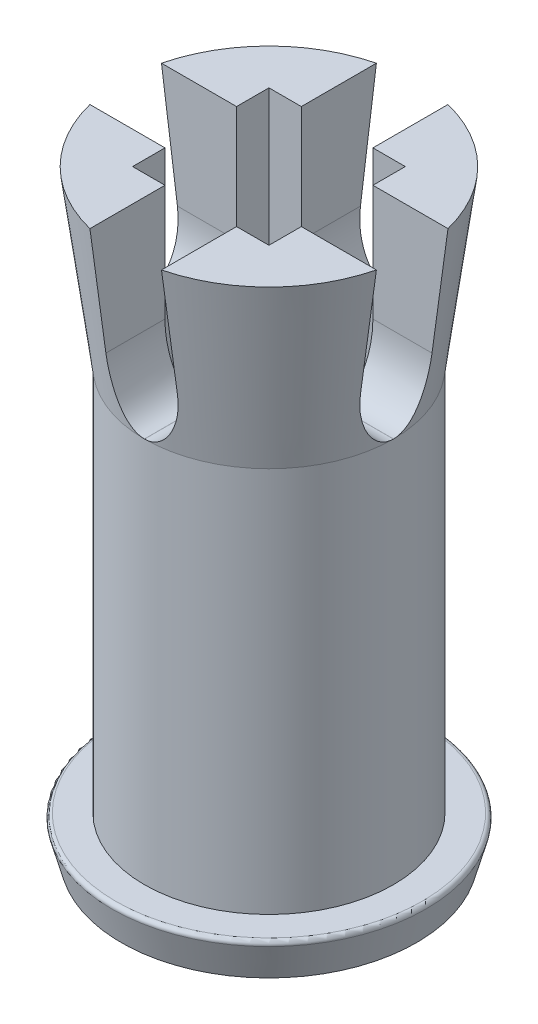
ISO-10303-21;
HEADER;
FILE_DESCRIPTION(('STEP AP214'),'2;1');
FILE_NAME('part.step','',(''),(''),'','','');
FILE_SCHEMA(('AUTOMOTIVE_DESIGN { 1 0 10303 214 1 1 1 1 }'));
ENDSEC;
DATA;
#1=APPLICATION_CONTEXT('core data for automotive mechanical design processes');
#2=APPLICATION_PROTOCOL_DEFINITION('international standard','automotive_design',2000,#1);
#3=PRODUCT_CONTEXT('',#1,'mechanical');
#4=PRODUCT('Part','Part','',(#3));
#5=PRODUCT_RELATED_PRODUCT_CATEGORY('part','',(#4));
#6=PRODUCT_DEFINITION_FORMATION('','',#4);
#7=PRODUCT_DEFINITION_CONTEXT('part definition',#1,'design');
#8=PRODUCT_DEFINITION('design','',#6,#7);
#9=PRODUCT_DEFINITION_SHAPE('','',#8);
#10=(LENGTH_UNIT() NAMED_UNIT(*) SI_UNIT(.MILLI.,.METRE.));
#11=(NAMED_UNIT(*) PLANE_ANGLE_UNIT() SI_UNIT($,.RADIAN.));
#12=(NAMED_UNIT(*) SI_UNIT($,.STERADIAN.) SOLID_ANGLE_UNIT());
#13=UNCERTAINTY_MEASURE_WITH_UNIT(LENGTH_MEASURE(1.E-05),#10,'distance_accuracy_value','');
#14=(GEOMETRIC_REPRESENTATION_CONTEXT(3) GLOBAL_UNCERTAINTY_ASSIGNED_CONTEXT((#13)) GLOBAL_UNIT_ASSIGNED_CONTEXT((#10,
#11,#12)) REPRESENTATION_CONTEXT('',''));
#15=CARTESIAN_POINT('',(0.,0.,0.));
#16=DIRECTION('',(0.,0.,1.));
#17=DIRECTION('',(1.,0.,0.));
#18=AXIS2_PLACEMENT_3D('',#15,#16,#17);
#19=CARTESIAN_POINT('',(0.,29.,0.));
#20=DIRECTION('',(0.,1.,0.));
#21=DIRECTION('',(0.,0.,1.));
#22=AXIS2_PLACEMENT_3D('',#19,#20,#21);
#23=PLANE('',#22);
#24=DIRECTION('',(0.,0.,-1.));
#25=VECTOR('',#24,1.);
#26=CARTESIAN_POINT('',(3.53233251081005,29.,0.));
#27=LINE('',#26,#25);
#28=CARTESIAN_POINT('',(3.53233251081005,29.,3.53233251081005));
#29=VERTEX_POINT('',#28);
#30=CARTESIAN_POINT('',(3.53233251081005,29.,1.85416666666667));
#31=VERTEX_POINT('',#30);
#32=EDGE_CURVE('E810',#29,#31,#27,.T.);
#33=ORIENTED_EDGE('',*,*,#32,.F.);
#34=DIRECTION('',(-1.,0.,0.));
#35=VECTOR('',#34,1.);
#36=CARTESIAN_POINT('',(0.,29.,3.53233251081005));
#37=LINE('',#36,#35);
#38=CARTESIAN_POINT('',(1.8541666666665,29.,3.53233251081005));
#39=VERTEX_POINT('',#38);
#40=EDGE_CURVE('E419',#29,#39,#37,.T.);
#41=ORIENTED_EDGE('',*,*,#40,.T.);
#42=DIRECTION('',(0.,0.,-1.));
#43=VECTOR('',#42,1.);
#44=CARTESIAN_POINT('',(1.8541666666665,29.,1.85416666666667));
#45=LINE('',#44,#43);
#46=CARTESIAN_POINT('',(1.8541666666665,29.,7.42189773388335));
#47=VERTEX_POINT('',#46);
#48=EDGE_CURVE('E491',#47,#39,#45,.T.);
#49=ORIENTED_EDGE('',*,*,#48,.F.);
#50=CARTESIAN_POINT('',(0.,29.,0.));
#51=DIRECTION('',(0.,1.,0.));
#52=DIRECTION('',(0.,0.,1.));
#53=AXIS2_PLACEMENT_3D('',#50,#51,#52);
#54=CIRCLE('',#53,7.65);
#55=CARTESIAN_POINT('',(7.42189773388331,29.,1.85416666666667));
#56=VERTEX_POINT('',#55);
#57=EDGE_CURVE('E258',#47,#56,#54,.T.);
#58=ORIENTED_EDGE('',*,*,#57,.T.);
#59=DIRECTION('',(1.,0.,0.));
#60=VECTOR('',#59,1.);
#61=CARTESIAN_POINT('',(1.8541666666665,29.,1.85416666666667));
#62=LINE('',#61,#60);
#63=EDGE_CURVE('E493',#31,#56,#62,.T.);
#64=ORIENTED_EDGE('',*,*,#63,.F.);
#65=EDGE_LOOP('',(#33,#41,#49,#58,#64));
#66=FACE_BOUND('',#65,.T.);
#67=ADVANCED_FACE('F47',(#66),#23,.T.);
#68=DIRECTION('',(-1.,0.,0.));
#69=VECTOR('',#68,1.);
#70=CARTESIAN_POINT('',(0.,29.,3.53233251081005));
#71=LINE('',#70,#69);
#72=CARTESIAN_POINT('',(-1.8541666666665,29.,3.53233251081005));
#73=VERTEX_POINT('',#72);
#74=CARTESIAN_POINT('',(-3.53233251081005,29.,3.53233251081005));
#75=VERTEX_POINT('',#74);
#76=EDGE_CURVE('E408',#73,#75,#71,.T.);
#77=ORIENTED_EDGE('',*,*,#76,.T.);
#78=DIRECTION('',(0.,0.,-1.));
#79=VECTOR('',#78,1.);
#80=CARTESIAN_POINT('',(-3.53233251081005,29.,0.));
#81=LINE('',#80,#79);
#82=CARTESIAN_POINT('',(-3.53233251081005,29.,1.85416666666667));
#83=VERTEX_POINT('',#82);
#84=EDGE_CURVE('E428',#75,#83,#81,.T.);
#85=ORIENTED_EDGE('',*,*,#84,.T.);
#86=DIRECTION('',(1.,0.,0.));
#87=VECTOR('',#86,1.);
#88=CARTESIAN_POINT('',(-7.65,29.,1.85416666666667));
#89=LINE('',#88,#87);
#90=CARTESIAN_POINT('',(-7.42189773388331,29.,1.85416666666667));
#91=VERTEX_POINT('',#90);
#92=EDGE_CURVE('E492',#91,#83,#89,.T.);
#93=ORIENTED_EDGE('',*,*,#92,.F.);
#94=CARTESIAN_POINT('',(-1.8541666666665,29.,7.42189773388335));
#95=VERTEX_POINT('',#94);
#96=EDGE_CURVE('E318',#91,#95,#54,.T.);
#97=ORIENTED_EDGE('',*,*,#96,.T.);
#98=DIRECTION('',(0.,0.,1.));
#99=VECTOR('',#98,1.);
#100=CARTESIAN_POINT('',(-1.8541666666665,29.,1.85416666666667));
#101=LINE('',#100,#99);
#102=EDGE_CURVE('E488',#73,#95,#101,.T.);
#103=ORIENTED_EDGE('',*,*,#102,.F.);
#104=EDGE_LOOP('',(#77,#85,#93,#97,#103));
#105=FACE_BOUND('',#104,.T.);
#106=ADVANCED_FACE('F575',(#105),#23,.T.);
#107=DIRECTION('',(-1.,0.,0.));
#108=VECTOR('',#107,1.);
#109=CARTESIAN_POINT('',(-7.65,29.,-1.85416666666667));
#110=LINE('',#109,#108);
#111=CARTESIAN_POINT('',(-3.53233251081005,29.,-1.85416666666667));
#112=VERTEX_POINT('',#111);
#113=CARTESIAN_POINT('',(-7.42189773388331,29.,-1.85416666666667));
#114=VERTEX_POINT('',#113);
#115=EDGE_CURVE('E485',#112,#114,#110,.T.);
#116=ORIENTED_EDGE('',*,*,#115,.F.);
#117=DIRECTION('',(0.,0.,-1.));
#118=VECTOR('',#117,1.);
#119=CARTESIAN_POINT('',(-3.53233251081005,29.,0.));
#120=LINE('',#119,#118);
#121=CARTESIAN_POINT('',(-3.53233251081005,29.,-3.53233251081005));
#122=VERTEX_POINT('',#121);
#123=EDGE_CURVE('E422',#112,#122,#120,.T.);
#124=ORIENTED_EDGE('',*,*,#123,.T.);
#125=DIRECTION('',(-1.,0.,0.));
#126=VECTOR('',#125,1.);
#127=CARTESIAN_POINT('',(0.,29.,-3.53233251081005));
#128=LINE('',#127,#126);
#129=CARTESIAN_POINT('',(-1.8541666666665,29.,-3.53233251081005));
#130=VERTEX_POINT('',#129);
#131=EDGE_CURVE('E548',#130,#122,#128,.T.);
#132=ORIENTED_EDGE('',*,*,#131,.F.);
#133=DIRECTION('',(0.,0.,1.));
#134=VECTOR('',#133,1.);
#135=CARTESIAN_POINT('',(-1.8541666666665,29.,-7.65));
#136=LINE('',#135,#134);
#137=CARTESIAN_POINT('',(-1.8541666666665,29.,-7.42189773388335));
#138=VERTEX_POINT('',#137);
#139=EDGE_CURVE('E518',#138,#130,#136,.T.);
#140=ORIENTED_EDGE('',*,*,#139,.F.);
#141=EDGE_CURVE('E585',#138,#114,#54,.T.);
#142=ORIENTED_EDGE('',*,*,#141,.T.);
#143=EDGE_LOOP('',(#116,#124,#132,#140,#142));
#144=FACE_BOUND('',#143,.T.);
#145=ADVANCED_FACE('F750',(#144),#23,.T.);
#146=CARTESIAN_POINT('',(1.8541666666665,20.,1.85416666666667));
#147=DIRECTION('',(1.,0.,0.));
#148=DIRECTION('',(0.,0.,-1.));
#149=AXIS2_PLACEMENT_3D('',#146,#147,#148);
#150=PLANE('',#149);
#151=DIRECTION('',(0.,1.,0.));
#152=VECTOR('',#151,1.);
#153=CARTESIAN_POINT('',(1.8541666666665,20.,3.53233251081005));
#154=LINE('',#153,#152);
#155=CARTESIAN_POINT('',(1.8541666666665,23.,3.53233251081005));
#156=VERTEX_POINT('',#155);
#157=EDGE_CURVE('E400',#156,#39,#154,.T.);
#158=ORIENTED_EDGE('',*,*,#157,.F.);
#159=CARTESIAN_POINT('',(1.8541666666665,23.,6.74738034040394));
#160=CARTESIAN_POINT('',(1.8541666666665,23.,5.62466522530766));
#161=CARTESIAN_POINT('',(1.8541666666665,23.,4.50195011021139));
#162=CARTESIAN_POINT('',(1.8541666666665,23.,3.3792349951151));
#163=(BOUNDED_CURVE() B_SPLINE_CURVE(3,(#159,#160,#161,#162),.UNSPECIFIED.,.F.,
.F.) B_SPLINE_CURVE_WITH_KNOTS((4,4),(-0.00674738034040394,-0.0033792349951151),
.UNSPECIFIED.) CURVE() GEOMETRIC_REPRESENTATION_ITEM() RATIONAL_B_SPLINE_CURVE((1.,1.,1.,1.)) REPRESENTATION_ITEM(''));
#164=CARTESIAN_POINT('',(1.8541666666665,23.,6.59428282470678));
#165=VERTEX_POINT('',#164);
#166=EDGE_CURVE('E800',#156,#165,#163,.F.);
#167=ORIENTED_EDGE('',*,*,#166,.T.);
#168=CARTESIAN_POINT('',(1.8541666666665,9.2950494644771,4.66790238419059));
#169=CARTESIAN_POINT('',(1.8541666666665,10.0269508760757,4.7728999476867));
#170=CARTESIAN_POINT('',(1.8541666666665,10.7589181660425,4.87743697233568));
#171=CARTESIAN_POINT('',(1.8541666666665,12.2229637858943,5.08572882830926));
#172=CARTESIAN_POINT('',(1.8541666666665,12.9550421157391,5.1894836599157));
#173=CARTESIAN_POINT('',(1.8541666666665,15.1514104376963,5.4997828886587));
#174=CARTESIAN_POINT('',(1.8541666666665,16.6158367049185,5.70536244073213));
#175=CARTESIAN_POINT('',(1.8541666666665,19.8819137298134,6.16176785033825));
#176=CARTESIAN_POINT('',(1.8541666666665,21.6836304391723,6.4121211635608));
#177=CARTESIAN_POINT('',(1.8541666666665,25.2873342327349,6.91087706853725));
#178=CARTESIAN_POINT('',(1.8541666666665,27.0893213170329,7.15927965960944));
#179=CARTESIAN_POINT('',(1.8541666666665,30.6934997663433,7.65466689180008));
#180=CARTESIAN_POINT('',(1.8541666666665,32.4956911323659,7.90165152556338));
#181=CARTESIAN_POINT('',(1.8541666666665,36.10022131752,8.39453077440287));
#182=CARTESIAN_POINT('',(1.8541666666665,37.9025601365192,8.64042539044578));
#183=CARTESIAN_POINT('',(1.8541666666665,39.7049505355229,8.88593983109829));
#184=B_SPLINE_CURVE_WITH_KNOTS('',3,(#168,#169,#170,#171,#172,#173,#174,#175,#176,#177,#178,
#179,#180,#181,#182,#183),.UNSPECIFIED.,.F.,.F.,(4,2,2,2,2,2,2,4),(0.,2.21818294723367,
4.43636509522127,8.87272047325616,14.3298005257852,19.7868824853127,25.2439927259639,
30.7010981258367),.UNSPECIFIED.);
#185=EDGE_CURVE('E409',#165,#47,#184,.T.);
#186=ORIENTED_EDGE('',*,*,#185,.T.);
#187=ORIENTED_EDGE('',*,*,#48,.T.);
#188=EDGE_LOOP('',(#158,#167,#186,#187));
#189=FACE_BOUND('',#188,.T.);
#190=ADVANCED_FACE('F762',(#189),#150,.F.);
#191=CARTESIAN_POINT('',(-1.8541666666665,20.,1.85416666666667));
#192=DIRECTION('',(-1.,0.,0.));
#193=DIRECTION('',(0.,0.,1.));
#194=AXIS2_PLACEMENT_3D('',#191,#192,#193);
#195=PLANE('',#194);
#196=CARTESIAN_POINT('',(-1.8541666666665,39.7049505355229,8.88593983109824));
#197=CARTESIAN_POINT('',(-1.8541666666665,38.3808934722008,8.70559485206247));
#198=CARTESIAN_POINT('',(-1.8541666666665,37.0568664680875,8.52502948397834));
#199=CARTESIAN_POINT('',(-1.8541666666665,34.4088869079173,8.16335330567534));
#200=CARTESIAN_POINT('',(-1.8541666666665,33.0849343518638,7.98224249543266));
#201=CARTESIAN_POINT('',(-1.8541666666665,29.1132176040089,7.43793596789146));
#202=CARTESIAN_POINT('',(-1.8541666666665,26.4655867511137,7.07376512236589));
#203=CARTESIAN_POINT('',(-1.8541666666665,22.6076260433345,6.54007067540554));
#204=CARTESIAN_POINT('',(-1.8541666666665,21.3970716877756,6.37217017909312));
#205=CARTESIAN_POINT('',(-1.8541666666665,18.9761165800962,6.03526740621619));
#206=CARTESIAN_POINT('',(-1.8541666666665,17.7657158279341,5.86626512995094));
#207=CARTESIAN_POINT('',(-1.8541666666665,15.3451075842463,5.52685749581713));
#208=CARTESIAN_POINT('',(-1.8541666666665,14.1349000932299,5.35645213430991));
#209=CARTESIAN_POINT('',(-1.8541666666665,11.7147542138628,5.01373396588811));
#210=CARTESIAN_POINT('',(-1.8541666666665,10.5048158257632,4.84142115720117));
#211=CARTESIAN_POINT('',(-1.8541666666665,9.2950494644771,4.66790238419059));
#212=B_SPLINE_CURVE_WITH_KNOTS('',3,(#196,#197,#198,#199,#200,#201,#202,#203,#204,#205,#206,
#207,#208,#209,#210,#211),.UNSPECIFIED.,.F.,.F.,(4,2,2,2,2,2,2,4),(0.,4.00884793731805,
8.01769604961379,16.0353693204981,19.701796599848,23.3682228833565,27.0346586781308,
30.7010978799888),.UNSPECIFIED.);
#213=CARTESIAN_POINT('',(-1.8541666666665,23.,6.59428282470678));
#214=VERTEX_POINT('',#213);
#215=EDGE_CURVE('E434',#95,#214,#212,.T.);
#216=ORIENTED_EDGE('',*,*,#215,.T.);
#217=CARTESIAN_POINT('',(-1.8541666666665,23.,3.37923499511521));
#218=CARTESIAN_POINT('',(-1.8541666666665,23.,4.50195011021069));
#219=CARTESIAN_POINT('',(-1.8541666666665,23.,5.62466522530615));
#220=CARTESIAN_POINT('',(-1.8541666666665,23.,6.74738034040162));
#221=(BOUNDED_CURVE() B_SPLINE_CURVE(3,(#217,#218,#219,#220),.UNSPECIFIED.,.F.,
.F.) B_SPLINE_CURVE_WITH_KNOTS((4,4),(0.00337923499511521,0.00674738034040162),
.UNSPECIFIED.) CURVE() GEOMETRIC_REPRESENTATION_ITEM() RATIONAL_B_SPLINE_CURVE((1.,1.,1.,1.)) REPRESENTATION_ITEM(''));
#222=CARTESIAN_POINT('',(-1.8541666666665,23.,3.53233251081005));
#223=VERTEX_POINT('',#222);
#224=EDGE_CURVE('E725',#214,#223,#221,.F.);
#225=ORIENTED_EDGE('',*,*,#224,.T.);
#226=DIRECTION('',(0.,-1.,0.));
#227=VECTOR('',#226,1.);
#228=CARTESIAN_POINT('',(-1.8541666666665,20.,3.53233251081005));
#229=LINE('',#228,#227);
#230=EDGE_CURVE('E274',#73,#223,#229,.T.);
#231=ORIENTED_EDGE('',*,*,#230,.F.);
#232=ORIENTED_EDGE('',*,*,#102,.T.);
#233=EDGE_LOOP('',(#216,#225,#231,#232));
#234=FACE_BOUND('',#233,.T.);
#235=ADVANCED_FACE('F461',(#234),#195,.F.);
#236=CARTESIAN_POINT('',(-7.65,20.,1.85416666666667));
#237=DIRECTION('',(0.,0.,1.));
#238=DIRECTION('',(1.,0.,0.));
#239=AXIS2_PLACEMENT_3D('',#236,#237,#238);
#240=PLANE('',#239);
#241=DIRECTION('',(0.,1.,0.));
#242=VECTOR('',#241,1.);
#243=CARTESIAN_POINT('',(-3.53233251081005,20.,1.85416666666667));
#244=LINE('',#243,#242);
#245=CARTESIAN_POINT('',(-3.53233251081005,23.,1.85416666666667));
#246=VERTEX_POINT('',#245);
#247=EDGE_CURVE('E425',#246,#83,#244,.T.);
#248=ORIENTED_EDGE('',*,*,#247,.F.);
#249=CARTESIAN_POINT('',(-6.74738034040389,23.,1.85416666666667));
#250=CARTESIAN_POINT('',(-5.62466522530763,23.,1.85416666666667));
#251=CARTESIAN_POINT('',(-4.50195011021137,23.,1.85416666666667));
#252=CARTESIAN_POINT('',(-3.3792349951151,23.,1.85416666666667));
#253=(BOUNDED_CURVE() B_SPLINE_CURVE(3,(#249,#250,#251,#252),.UNSPECIFIED.,.F.,
.F.) B_SPLINE_CURVE_WITH_KNOTS((4,4),(-0.00674738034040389,-0.0033792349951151),
.UNSPECIFIED.) CURVE() GEOMETRIC_REPRESENTATION_ITEM() RATIONAL_B_SPLINE_CURVE((1.,1.,1.,1.)) REPRESENTATION_ITEM(''));
#254=CARTESIAN_POINT('',(-6.59428282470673,23.,1.85416666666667));
#255=VERTEX_POINT('',#254);
#256=EDGE_CURVE('E602',#246,#255,#253,.F.);
#257=ORIENTED_EDGE('',*,*,#256,.T.);
#258=CARTESIAN_POINT('',(-4.66790238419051,9.29504946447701,1.85416666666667));
#259=CARTESIAN_POINT('',(-4.77289994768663,10.0269508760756,1.85416666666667));
#260=CARTESIAN_POINT('',(-4.8774369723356,10.7589181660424,1.85416666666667));
#261=CARTESIAN_POINT('',(-5.08572882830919,12.2229637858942,1.85416666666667));
#262=CARTESIAN_POINT('',(-5.18948365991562,12.955042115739,1.85416666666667));
#263=CARTESIAN_POINT('',(-5.49978288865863,15.1514104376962,1.85416666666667));
#264=CARTESIAN_POINT('',(-5.70536244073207,16.6158367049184,1.85416666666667));
#265=CARTESIAN_POINT('',(-6.16176785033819,19.8819137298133,1.85416666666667));
#266=CARTESIAN_POINT('',(-6.41212116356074,21.6836304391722,1.85416666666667));
#267=CARTESIAN_POINT('',(-6.9108770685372,25.2873342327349,1.85416666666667));
#268=CARTESIAN_POINT('',(-7.15927965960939,27.0893213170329,1.85416666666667));
#269=CARTESIAN_POINT('',(-7.65466689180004,30.6934997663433,1.85416666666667));
#270=CARTESIAN_POINT('',(-7.90165152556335,32.4956911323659,1.85416666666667));
#271=CARTESIAN_POINT('',(-8.39453077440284,36.10022131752,1.85416666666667));
#272=CARTESIAN_POINT('',(-8.64042539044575,37.9025601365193,1.85416666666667));
#273=CARTESIAN_POINT('',(-8.88593983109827,39.704950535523,1.85416666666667));
#274=B_SPLINE_CURVE_WITH_KNOTS('',3,(#258,#259,#260,#261,#262,#263,#264,#265,#266,#267,#268,
#269,#270,#271,#272,#273),.UNSPECIFIED.,.F.,.F.,(4,2,2,2,2,2,2,4),(0.,2.21818294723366,
4.43636509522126,8.87272047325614,14.3298005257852,19.7868824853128,25.2439927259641,
30.7010981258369),.UNSPECIFIED.);
#275=EDGE_CURVE('E431',#255,#91,#274,.T.);
#276=ORIENTED_EDGE('',*,*,#275,.T.);
#277=ORIENTED_EDGE('',*,*,#92,.T.);
#278=EDGE_LOOP('',(#248,#257,#276,#277));
#279=FACE_BOUND('',#278,.T.);
#280=ADVANCED_FACE('F456',(#279),#240,.F.);
#281=CARTESIAN_POINT('',(-7.65,20.,-1.85416666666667));
#282=DIRECTION('',(0.,0.,-1.));
#283=DIRECTION('',(-1.,0.,0.));
#284=AXIS2_PLACEMENT_3D('',#281,#282,#283);
#285=PLANE('',#284);
#286=CARTESIAN_POINT('',(-8.88593983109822,39.704950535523,-1.85416666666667));
#287=CARTESIAN_POINT('',(-8.70559485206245,38.3808934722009,-1.85416666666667));
#288=CARTESIAN_POINT('',(-8.52502948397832,37.0568664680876,-1.85416666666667));
#289=CARTESIAN_POINT('',(-8.16335330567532,34.4088869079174,-1.85416666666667));
#290=CARTESIAN_POINT('',(-7.98224249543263,33.0849343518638,-1.85416666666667));
#291=CARTESIAN_POINT('',(-7.43793596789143,29.113217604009,-1.85416666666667));
#292=CARTESIAN_POINT('',(-7.07376512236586,26.4655867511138,-1.85416666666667));
#293=CARTESIAN_POINT('',(-6.5400706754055,22.6076260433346,-1.85416666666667));
#294=CARTESIAN_POINT('',(-6.37217017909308,21.3970716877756,-1.85416666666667));
#295=CARTESIAN_POINT('',(-6.03526740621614,18.9761165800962,-1.85416666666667));
#296=CARTESIAN_POINT('',(-5.86626512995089,17.7657158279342,-1.85416666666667));
#297=CARTESIAN_POINT('',(-5.52685749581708,15.3451075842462,-1.85416666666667));
#298=CARTESIAN_POINT('',(-5.35645213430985,14.1349000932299,-1.85416666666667));
#299=CARTESIAN_POINT('',(-5.01373396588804,11.7147542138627,-1.85416666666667));
#300=CARTESIAN_POINT('',(-4.8414211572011,10.5048158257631,-1.85416666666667));
#301=CARTESIAN_POINT('',(-4.66790238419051,9.29504946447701,-1.85416666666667));
#302=B_SPLINE_CURVE_WITH_KNOTS('',3,(#286,#287,#288,#289,#290,#291,#292,#293,#294,#295,#296,
#297,#298,#299,#300,#301),.UNSPECIFIED.,.F.,.F.,(4,2,2,2,2,2,2,4),(0.,4.00884793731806,
8.0176960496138,16.0353693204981,19.7017965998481,23.3682228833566,27.034658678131,
30.701097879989),.UNSPECIFIED.);
#303=CARTESIAN_POINT('',(-6.59428282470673,23.,-1.85416666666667));
#304=VERTEX_POINT('',#303);
#305=EDGE_CURVE('E251',#114,#304,#302,.T.);
#306=ORIENTED_EDGE('',*,*,#305,.T.);
#307=CARTESIAN_POINT('',(-3.37923499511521,23.,-1.85416666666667));
#308=CARTESIAN_POINT('',(-4.50195011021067,23.,-1.85416666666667));
#309=CARTESIAN_POINT('',(-5.62466522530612,23.,-1.85416666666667));
#310=CARTESIAN_POINT('',(-6.74738034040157,23.,-1.85416666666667));
#311=(BOUNDED_CURVE() B_SPLINE_CURVE(3,(#307,#308,#309,#310),.UNSPECIFIED.,.F.,
.F.) B_SPLINE_CURVE_WITH_KNOTS((4,4),(0.00337923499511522,0.00674738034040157),
.UNSPECIFIED.) CURVE() GEOMETRIC_REPRESENTATION_ITEM() RATIONAL_B_SPLINE_CURVE((1.,1.,1.,1.)) REPRESENTATION_ITEM(''));
#312=CARTESIAN_POINT('',(-3.53233251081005,23.,-1.85416666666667));
#313=VERTEX_POINT('',#312);
#314=EDGE_CURVE('E588',#304,#313,#311,.F.);
#315=ORIENTED_EDGE('',*,*,#314,.T.);
#316=DIRECTION('',(0.,-1.,0.));
#317=VECTOR('',#316,1.);
#318=CARTESIAN_POINT('',(-3.53233251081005,20.,-1.85416666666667));
#319=LINE('',#318,#317);
#320=EDGE_CURVE('E470',#112,#313,#319,.T.);
#321=ORIENTED_EDGE('',*,*,#320,.F.);
#322=ORIENTED_EDGE('',*,*,#115,.T.);
#323=EDGE_LOOP('',(#306,#315,#321,#322));
#324=FACE_BOUND('',#323,.T.);
#325=ADVANCED_FACE('F460',(#324),#285,.F.);
#326=DIRECTION('',(0.,0.,-1.));
#327=VECTOR('',#326,1.);
#328=CARTESIAN_POINT('',(3.53233251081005,29.,0.));
#329=LINE('',#328,#327);
#330=CARTESIAN_POINT('',(3.53233251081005,29.,-1.85416666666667));
#331=VERTEX_POINT('',#330);
#332=CARTESIAN_POINT('',(3.53233251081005,29.,-3.53233251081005));
#333=VERTEX_POINT('',#332);
#334=EDGE_CURVE('E247',#331,#333,#329,.T.);
#335=ORIENTED_EDGE('',*,*,#334,.F.);
#336=DIRECTION('',(-1.,0.,0.));
#337=VECTOR('',#336,1.);
#338=CARTESIAN_POINT('',(1.8541666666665,29.,-1.85416666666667));
#339=LINE('',#338,#337);
#340=CARTESIAN_POINT('',(7.42189773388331,29.,-1.85416666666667));
#341=VERTEX_POINT('',#340);
#342=EDGE_CURVE('E508',#341,#331,#339,.T.);
#343=ORIENTED_EDGE('',*,*,#342,.F.);
#344=CARTESIAN_POINT('',(1.8541666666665,29.,-7.42189773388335));
#345=VERTEX_POINT('',#344);
#346=EDGE_CURVE('E261',#341,#345,#54,.T.);
#347=ORIENTED_EDGE('',*,*,#346,.T.);
#348=DIRECTION('',(0.,0.,-1.));
#349=VECTOR('',#348,1.);
#350=CARTESIAN_POINT('',(1.8541666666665,29.,-7.65));
#351=LINE('',#350,#349);
#352=CARTESIAN_POINT('',(1.8541666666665,29.,-3.53233251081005));
#353=VERTEX_POINT('',#352);
#354=EDGE_CURVE('E511',#353,#345,#351,.T.);
#355=ORIENTED_EDGE('',*,*,#354,.F.);
#356=DIRECTION('',(-1.,0.,0.));
#357=VECTOR('',#356,1.);
#358=CARTESIAN_POINT('',(0.,29.,-3.53233251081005));
#359=LINE('',#358,#357);
#360=EDGE_CURVE('E549',#333,#353,#359,.T.);
#361=ORIENTED_EDGE('',*,*,#360,.F.);
#362=EDGE_LOOP('',(#335,#343,#347,#355,#361));
#363=FACE_BOUND('',#362,.T.);
#364=ADVANCED_FACE('F746',(#363),#23,.T.);
#365=CARTESIAN_POINT('',(0.,20.,0.));
#366=DIRECTION('',(0.,1.,0.));
#367=DIRECTION('',(0.,0.,1.));
#368=AXIS2_PLACEMENT_3D('',#365,#366,#367);
#369=CONICAL_SURFACE('',#368,6.45,0.132551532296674);
#370=CARTESIAN_POINT('',(-1.8541666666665,9.2950494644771,-4.66790238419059));
#371=CARTESIAN_POINT('',(-1.8541666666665,10.0269508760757,-4.77289994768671));
#372=CARTESIAN_POINT('',(-1.8541666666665,10.7589181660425,-4.87743697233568));
#373=CARTESIAN_POINT('',(-1.8541666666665,12.2229637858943,-5.08572882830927));
#374=CARTESIAN_POINT('',(-1.8541666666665,12.9550421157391,-5.1894836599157));
#375=CARTESIAN_POINT('',(-1.8541666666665,15.1514104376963,-5.4997828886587));
#376=CARTESIAN_POINT('',(-1.8541666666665,16.6158367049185,-5.70536244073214));
#377=CARTESIAN_POINT('',(-1.8541666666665,19.8819137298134,-6.16176785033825));
#378=CARTESIAN_POINT('',(-1.8541666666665,21.6836304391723,-6.4121211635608));
#379=CARTESIAN_POINT('',(-1.8541666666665,25.2873342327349,-6.91087706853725));
#380=CARTESIAN_POINT('',(-1.8541666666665,27.089321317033,-7.15927965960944));
#381=CARTESIAN_POINT('',(-1.8541666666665,30.6934997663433,-7.65466689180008));
#382=CARTESIAN_POINT('',(-1.8541666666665,32.4956911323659,-7.90165152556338));
#383=CARTESIAN_POINT('',(-1.8541666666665,36.10022131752,-8.39453077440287));
#384=CARTESIAN_POINT('',(-1.8541666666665,37.9025601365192,-8.64042539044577));
#385=CARTESIAN_POINT('',(-1.8541666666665,39.7049505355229,-8.88593983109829));
#386=B_SPLINE_CURVE_WITH_KNOTS('',3,(#370,#371,#372,#373,#374,#375,#376,#377,#378,#379,#380,
#381,#382,#383,#384,#385),.UNSPECIFIED.,.F.,.F.,(4,2,2,2,2,2,2,4),(0.,2.21818294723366,
4.43636509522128,8.87272047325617,14.3298005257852,19.7868824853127,25.2439927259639,
30.7010981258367),.UNSPECIFIED.);
#387=CARTESIAN_POINT('',(-1.8541666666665,23.,-6.59428282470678));
#388=VERTEX_POINT('',#387);
#389=EDGE_CURVE('E480',#388,#138,#386,.T.);
#390=ORIENTED_EDGE('',*,*,#389,.F.);
#391=CARTESIAN_POINT('',(-0.00416666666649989,20.,-6.44999865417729));
#392=CARTESIAN_POINT('',(-0.0140790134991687,19.9999999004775,-6.44999151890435));
#393=CARTESIAN_POINT('',(-0.0239913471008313,20.0001291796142,-6.44996876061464));
#394=CARTESIAN_POINT('',(-0.0449315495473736,20.0006750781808,-6.44989453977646));
#395=CARTESIAN_POINT('',(-0.0559586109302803,20.0011225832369,-6.44984011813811));
#396=CARTESIAN_POINT('',(-0.0791459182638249,20.0023999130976,-6.44970281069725));
#397=CARTESIAN_POINT('',(-0.0913042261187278,20.0032647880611,-6.44961754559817));
#398=CARTESIAN_POINT('',(-0.116770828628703,20.0054841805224,-6.44941787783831));
#399=CARTESIAN_POINT('',(-0.130075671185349,20.006878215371,-6.44930144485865));
#400=CARTESIAN_POINT('',(-0.157850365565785,20.0102764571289,-6.44903918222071));
#401=CARTESIAN_POINT('',(-0.172314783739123,20.0123250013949,-6.44889163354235));
#402=CARTESIAN_POINT('',(-0.202420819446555,20.017166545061,-6.44856683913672));
#403=CARTESIAN_POINT('',(-0.218054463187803,20.0200090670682,-6.44838812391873));
#404=CARTESIAN_POINT('',(-0.250507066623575,20.0265871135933,-6.44800076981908));
#405=CARTESIAN_POINT('',(-0.267314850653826,20.030377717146,-6.44779087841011));
#406=CARTESIAN_POINT('',(-0.302118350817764,20.0390150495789,-6.44734096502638));
#407=CARTESIAN_POINT('',(-0.320098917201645,20.0439227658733,-6.44709988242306));
#408=CARTESIAN_POINT('',(-0.357243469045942,20.0549720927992,-6.44658740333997));
#409=CARTESIAN_POINT('',(-0.376387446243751,20.0611809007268,-6.44631512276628));
#410=CARTESIAN_POINT('',(-0.415845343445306,20.0750245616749,-6.44574007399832));
#411=CARTESIAN_POINT('',(-0.436133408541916,20.0827330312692,-6.4454365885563));
#412=CARTESIAN_POINT('',(-0.477855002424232,20.0997818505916,-6.44479897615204));
#413=CARTESIAN_POINT('',(-0.499255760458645,20.1092023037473,-6.44446429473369));
#414=CARTESIAN_POINT('',(-0.543165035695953,20.1298933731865,-6.44376409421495));
#415=CARTESIAN_POINT('',(-0.565632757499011,20.1412504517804,-6.44339817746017));
#416=CARTESIAN_POINT('',(-0.611622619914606,20.1660435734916,-6.44263551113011));
#417=CARTESIAN_POINT('',(-0.635094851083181,20.1795720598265,-6.44223853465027));
#418=CARTESIAN_POINT('',(-0.683022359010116,20.2089446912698,-6.44141293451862));
#419=CARTESIAN_POINT('',(-0.707417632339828,20.2248865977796,-6.44098418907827));
#420=CARTESIAN_POINT('',(-0.75709890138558,20.2593266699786,-6.44009767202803));
#421=CARTESIAN_POINT('',(-0.782313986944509,20.2779269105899,-6.43964014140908));
#422=CARTESIAN_POINT('',(-0.833520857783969,20.3179249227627,-6.43868440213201));
#423=CARTESIAN_POINT('',(-0.859430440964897,20.3394278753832,-6.4381857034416));
#424=CARTESIAN_POINT('',(-0.901482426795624,20.3763347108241,-6.437391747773));
#425=CARTESIAN_POINT('',(-0.917970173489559,20.391347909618,-6.43708463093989));
#426=CARTESIAN_POINT('',(-0.950316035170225,20.421851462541,-6.43652240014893));
#427=CARTESIAN_POINT('',(-0.966177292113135,20.4373384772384,-6.43626698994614));
#428=CARTESIAN_POINT('',(-0.997262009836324,20.4687144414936,-6.435799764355));
#429=CARTESIAN_POINT('',(-1.01248931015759,20.4845995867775,-6.43558764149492));
#430=CARTESIAN_POINT('',(-1.04230168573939,20.5166978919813,-6.43520931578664));
#431=CARTESIAN_POINT('',(-1.0568912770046,20.5329068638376,-6.43504272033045));
#432=CARTESIAN_POINT('',(-1.09944700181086,20.581633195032,-6.43461349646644));
#433=CARTESIAN_POINT('',(-1.12671036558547,20.6147686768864,-6.43441371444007));
#434=CARTESIAN_POINT('',(-1.17867023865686,20.6815292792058,-6.43419873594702));
#435=CARTESIAN_POINT('',(-1.20341682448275,20.7151156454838,-6.43417859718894));
#436=CARTESIAN_POINT('',(-1.25041138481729,20.782275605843,-6.43432396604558));
#437=CARTESIAN_POINT('',(-1.27271614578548,20.8158095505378,-6.43448308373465));
#438=CARTESIAN_POINT('',(-1.3149247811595,20.8824057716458,-6.43498923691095));
#439=CARTESIAN_POINT('',(-1.33489000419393,20.9154293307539,-6.43532815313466));
#440=CARTESIAN_POINT('',(-1.37254306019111,20.9805982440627,-6.43619345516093));
#441=CARTESIAN_POINT('',(-1.39029459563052,21.0127069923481,-6.43670980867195));
#442=CARTESIAN_POINT('',(-1.42366028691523,21.0756909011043,-6.43794021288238));
#443=CARTESIAN_POINT('',(-1.43933858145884,21.1065324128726,-6.43864135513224));
#444=CARTESIAN_POINT('',(-1.47204480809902,21.1735104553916,-6.44039563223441));
#445=CARTESIAN_POINT('',(-1.4889058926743,21.209727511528,-6.44148645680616));
#446=CARTESIAN_POINT('',(-1.52144732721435,21.2829644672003,-6.44394161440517));
#447=CARTESIAN_POINT('',(-1.53711915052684,21.3199880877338,-6.44530770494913));
#448=CARTESIAN_POINT('',(-1.56726725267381,21.394694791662,-6.44832254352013));
#449=CARTESIAN_POINT('',(-1.58173802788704,21.4323800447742,-6.44997249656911));
#450=CARTESIAN_POINT('',(-1.60947747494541,21.5082679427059,-6.45355337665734));
#451=CARTESIAN_POINT('',(-1.62274351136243,21.5464715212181,-6.45548489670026));
#452=CARTESIAN_POINT('',(-1.64807516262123,21.6232577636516,-6.45963008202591));
#453=CARTESIAN_POINT('',(-1.66014082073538,21.6618404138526,-6.46184373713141));
#454=CARTESIAN_POINT('',(-1.68308020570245,21.7392489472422,-6.46655389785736));
#455=CARTESIAN_POINT('',(-1.69395644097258,21.7780741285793,-6.46904978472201));
#456=CARTESIAN_POINT('',(-1.72473736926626,21.8944011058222,-6.47693900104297));
#457=CARTESIAN_POINT('',(-1.74297943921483,21.9723202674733,-6.48276420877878));
#458=CARTESIAN_POINT('',(-1.77435955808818,22.1248560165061,-6.49533438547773));
#459=CARTESIAN_POINT('',(-1.78771341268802,22.1994340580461,-6.50201590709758));
#460=CARTESIAN_POINT('',(-1.81120252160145,22.3522112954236,-6.51672121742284));
#461=CARTESIAN_POINT('',(-1.82117848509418,22.4304306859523,-6.52478969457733));
#462=CARTESIAN_POINT('',(-1.8374754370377,22.5896452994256,-6.54227353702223));
#463=CARTESIAN_POINT('',(-1.84366990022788,22.6706495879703,-6.5517236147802));
#464=CARTESIAN_POINT('',(-1.85205628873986,22.8344640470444,-6.57199121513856));
#465=CARTESIAN_POINT('',(-1.85415952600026,22.917275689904,-6.58283371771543));
#466=CARTESIAN_POINT('',(-1.8541666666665,23.,-6.59428282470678));
#467=B_SPLINE_CURVE_WITH_KNOTS('',3,(#391,#392,#393,#394,#395,#396,#397,#398,#399,#400,#401,
#402,#403,#404,#405,#406,#407,#408,#409,#410,#411,#412,#413,#414,#415,#416,#417,#418,#419,#420,
#421,#422,#423,#424,#425,#426,#427,#428,#429,#430,#431,#432,#433,#434,#435,#436,#437,#438,#439,
#440,#441,#442,#443,#444,#445,#446,#447,#448,#449,#450,#451,#452,#453,#454,#455,#456,#457,#458,
#459,#460,#461,#462,#463,#464,#465,#466),.UNSPECIFIED.,.F.,.F.,(4,2,2,2,2,2,2,2,2,2,2,2,2,2,2,2,
2,2,2,2,2,2,2,2,2,2,2,2,2,2,2,2,2,2,2,2,2,4),(0.,0.0297362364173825,0.0628403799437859,
0.0994021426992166,0.139528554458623,0.183346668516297,0.231006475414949,0.282683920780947,
0.338583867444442,0.398942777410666,0.46403081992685,0.534153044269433,0.609649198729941,
0.690891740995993,0.778281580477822,0.872241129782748,0.973204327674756,1.04009485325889,
1.10659056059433,1.17259610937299,1.23801307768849,1.36666761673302,1.49177135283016,
1.61255283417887,1.72829388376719,1.83834655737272,1.94214250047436,2.06200818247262,
2.18266492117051,2.30384710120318,2.42528829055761,2.54672510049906,2.66790065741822,
2.90846598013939,3.13654266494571,3.37422763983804,3.61948257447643,3.86999728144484),.UNSPECIFIED.);
#468=CARTESIAN_POINT('',(-0.00416666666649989,20.,-6.44999865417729));
#469=VERTEX_POINT('',#468);
#470=EDGE_CURVE('E938',#388,#469,#467,.F.);
#471=ORIENTED_EDGE('',*,*,#470,.T.);
#472=CARTESIAN_POINT('',(0.,20.,0.));
#473=DIRECTION('',(0.,1.,0.));
#474=DIRECTION('',(0.,0.,1.));
#475=AXIS2_PLACEMENT_3D('',#472,#473,#474);
#476=CIRCLE('',#475,6.45);
#477=CARTESIAN_POINT('',(-6.44999865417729,20.,-0.00416666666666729));
#478=VERTEX_POINT('',#477);
#479=EDGE_CURVE('E293',#469,#478,#476,.T.);
#480=ORIENTED_EDGE('',*,*,#479,.T.);
#481=CARTESIAN_POINT('',(-6.59428282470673,23.,-1.85416666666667));
#482=CARTESIAN_POINT('',(-6.582817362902,22.917157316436,-1.85415948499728));
#483=CARTESIAN_POINT('',(-6.57196030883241,22.8342270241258,-1.85205024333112));
#484=CARTESIAN_POINT('',(-6.55166727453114,22.6701775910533,-1.84363973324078));
#485=CARTESIAN_POINT('',(-6.54220625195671,22.5890569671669,-1.83742737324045));
#486=CARTESIAN_POINT('',(-6.52470418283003,22.4296159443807,-1.8210832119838));
#487=CARTESIAN_POINT('',(-6.51662830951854,22.3512864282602,-1.81107836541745));
#488=CARTESIAN_POINT('',(-6.50191196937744,22.1982985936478,-1.787521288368));
#489=CARTESIAN_POINT('',(-6.49522664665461,22.1236199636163,-1.77412896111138));
#490=CARTESIAN_POINT('',(-6.48266309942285,21.9710158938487,-1.74268571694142));
#491=CARTESIAN_POINT('',(-6.47684634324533,21.8931278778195,-1.72442569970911));
#492=CARTESIAN_POINT('',(-6.46896908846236,21.7768474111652,-1.69361883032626));
#493=CARTESIAN_POINT('',(-6.46647705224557,21.7380371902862,-1.68273389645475));
#494=CARTESIAN_POINT('',(-6.46177435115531,21.6606581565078,-1.65977725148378));
#495=CARTESIAN_POINT('',(-6.45956431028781,21.6220900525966,-1.64770300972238));
#496=CARTESIAN_POINT('',(-6.45542610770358,21.545332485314,-1.62235427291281));
#497=CARTESIAN_POINT('',(-6.45349796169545,21.5071430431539,-1.60907971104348));
#498=CARTESIAN_POINT('',(-6.44992358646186,21.4312830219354,-1.58132323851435));
#499=CARTESIAN_POINT('',(-6.44827677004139,21.3936115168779,-1.56684393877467));
#500=CARTESIAN_POINT('',(-6.44526795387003,21.3189319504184,-1.53667875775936));
#501=CARTESIAN_POINT('',(-6.44390475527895,21.2819217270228,-1.52099835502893));
#502=CARTESIAN_POINT('',(-6.44145515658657,21.2087112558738,-1.48843967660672));
#503=CARTESIAN_POINT('',(-6.4403670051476,21.1725072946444,-1.4715699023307));
#504=CARTESIAN_POINT('',(-6.43861824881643,21.1055846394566,-1.43886244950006));
#505=CARTESIAN_POINT('',(-6.43791976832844,21.0747848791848,-1.42319258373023));
#506=CARTESIAN_POINT('',(-6.43669424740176,21.0118872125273,-1.38984695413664));
#507=CARTESIAN_POINT('',(-6.43618007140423,20.9798228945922,-1.37210721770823));
#508=CARTESIAN_POINT('',(-6.43531870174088,20.9147447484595,-1.33448141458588));
#509=CARTESIAN_POINT('',(-6.43498150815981,20.8817674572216,-1.31453180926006));
#510=CARTESIAN_POINT('',(-6.43447836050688,20.8152646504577,-1.27235847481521));
#511=CARTESIAN_POINT('',(-6.43432050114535,20.7817777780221,-1.2500735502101));
#512=CARTESIAN_POINT('',(-6.43417720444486,20.7147116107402,-1.20312306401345));
#513=CARTESIAN_POINT('',(-6.4341981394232,20.6811718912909,-1.17840084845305));
#514=CARTESIAN_POINT('',(-6.43441425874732,20.6145028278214,-1.12649435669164));
#515=CARTESIAN_POINT('',(-6.4346143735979,20.5814121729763,-1.09926010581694));
#516=CARTESIAN_POINT('',(-6.43504375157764,20.532750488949,-1.0567515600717));
#517=CARTESIAN_POINT('',(-6.43521034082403,20.5165627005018,-1.04217833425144));
#518=CARTESIAN_POINT('',(-6.4355885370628,20.4845057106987,-1.01239987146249));
#519=CARTESIAN_POINT('',(-6.43580053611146,20.468640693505,-0.997190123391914));
#520=CARTESIAN_POINT('',(-6.43626740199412,20.4373037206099,-0.966141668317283));
#521=CARTESIAN_POINT('',(-6.43652257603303,20.4218355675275,-0.950299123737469));
#522=CARTESIAN_POINT('',(-6.43708420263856,20.3913682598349,-0.917991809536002));
#523=CARTESIAN_POINT('',(-6.43739095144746,20.3763724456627,-0.901523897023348));
#524=CARTESIAN_POINT('',(-6.43818456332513,20.3394767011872,-0.85948837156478));
#525=CARTESIAN_POINT('',(-6.43868330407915,20.3179684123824,-0.833574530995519));
#526=CARTESIAN_POINT('',(-6.43963913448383,20.2779608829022,-0.782359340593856));
#527=CARTESIAN_POINT('',(-6.4400967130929,20.2593564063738,-0.757140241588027));
#528=CARTESIAN_POINT('',(-6.44098332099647,20.2249088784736,-0.707451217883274));
#529=CARTESIAN_POINT('',(-6.44141210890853,20.2089636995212,-0.68305224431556));
#530=CARTESIAN_POINT('',(-6.44223779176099,20.1795854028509,-0.635117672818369));
#531=CARTESIAN_POINT('',(-6.4426348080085,20.1660544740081,-0.611642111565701));
#532=CARTESIAN_POINT('',(-6.44339755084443,20.141257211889,-0.565645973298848));
#533=CARTESIAN_POINT('',(-6.44376350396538,20.1298983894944,-0.543175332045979));
#534=CARTESIAN_POINT('',(-6.44446377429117,20.1092044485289,-0.499260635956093));
#535=CARTESIAN_POINT('',(-6.44479848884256,20.0997828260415,-0.477857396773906));
#536=CARTESIAN_POINT('',(-6.44543616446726,20.0827321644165,-0.436131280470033));
#537=CARTESIAN_POINT('',(-6.4457396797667,20.0750229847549,-0.415841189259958));
#538=CARTESIAN_POINT('',(-6.44631478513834,20.0611782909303,-0.376379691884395));
#539=CARTESIAN_POINT('',(-6.44658709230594,20.0549691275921,-0.357234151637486));
#540=CARTESIAN_POINT('',(-6.44709962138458,20.0439193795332,-0.320086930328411));
#541=CARTESIAN_POINT('',(-6.44734072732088,20.0390115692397,-0.302105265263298));
#542=CARTESIAN_POINT('',(-6.4477906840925,20.0303742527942,-0.267300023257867));
#543=CARTESIAN_POINT('',(-6.4480005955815,20.0265837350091,-0.250491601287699));
#544=CARTESIAN_POINT('',(-6.44838798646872,20.0200059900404,-0.218038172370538));
#545=CARTESIAN_POINT('',(-6.44856671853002,20.0171636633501,-0.202404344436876));
#546=CARTESIAN_POINT('',(-6.44889154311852,20.0123225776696,-0.172298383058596));
#547=CARTESIAN_POINT('',(-6.44903910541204,20.0102742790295,-0.157834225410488));
#548=CARTESIAN_POINT('',(-6.44930139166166,20.0068765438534,-0.13006048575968));
#549=CARTESIAN_POINT('',(-6.4494178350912,20.0054827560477,-0.116756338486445));
#550=CARTESIAN_POINT('',(-6.44961751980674,20.0032638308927,-0.0912915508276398));
#551=CARTESIAN_POINT('',(-6.44970279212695,20.0023991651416,-0.0791343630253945));
#552=CARTESIAN_POINT('',(-6.44984011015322,20.0011221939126,-0.0559497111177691));
#553=CARTESIAN_POINT('',(-6.44989453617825,20.0006748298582,-0.0449241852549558));
#554=CARTESIAN_POINT('',(-6.44996876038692,20.0001291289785,-0.0239874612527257));
#555=CARTESIAN_POINT('',(-6.44999151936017,19.9999999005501,-0.0140770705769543));
#556=CARTESIAN_POINT('',(-6.44999865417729,20.,-0.00416666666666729));
#557=B_SPLINE_CURVE_WITH_KNOTS('',3,(#481,#482,#483,#484,#485,#486,#487,#488,#489,#490,#491,
#492,#493,#494,#495,#496,#497,#498,#499,#500,#501,#502,#503,#504,#505,#506,#507,#508,#509,#510,
#511,#512,#513,#514,#515,#516,#517,#518,#519,#520,#521,#522,#523,#524,#525,#526,#527,#528,#529,
#530,#531,#532,#533,#534,#535,#536,#537,#538,#539,#540,#541,#542,#543,#544,#545,#546,#547,#548,
#549,#550,#551,#552,#553,#554,#555,#556),.UNSPECIFIED.,.F.,.F.,(4,2,2,2,2,2,2,2,2,2,2,2,2,2,2,2,
2,2,2,2,2,2,2,2,2,2,2,2,2,2,2,2,2,2,2,2,2,4),(0.,0.250873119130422,0.496481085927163,
0.734504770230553,0.962898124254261,1.20338322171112,1.32452196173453,1.44592427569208,
1.56733335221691,1.68848584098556,1.80911532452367,1.92895617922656,2.03262893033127,
2.14254782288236,2.25814590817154,2.37877696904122,2.50372484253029,2.63222030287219,
2.6975572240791,2.76348278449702,2.82989883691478,2.89671029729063,2.99769350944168,
3.09167027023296,3.17907475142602,3.26032959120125,3.33583590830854,3.40596634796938,
3.47106082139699,3.53142451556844,3.58732771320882,3.63900696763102,3.6866672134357,
3.73048445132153,3.77060871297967,3.80716708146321,3.84026660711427,3.86999701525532),.UNSPECIFIED.);
#558=EDGE_CURVE('E597',#478,#304,#557,.F.);
#559=ORIENTED_EDGE('',*,*,#558,.T.);
#560=ORIENTED_EDGE('',*,*,#305,.F.);
#561=ORIENTED_EDGE('',*,*,#141,.F.);
#562=EDGE_LOOP('',(#390,#471,#480,#559,#560,#561));
#563=FACE_BOUND('',#562,.T.);
#564=ADVANCED_FACE('F754',(#563),#369,.T.);
#565=CARTESIAN_POINT('',(1.8541666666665,39.7049505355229,-8.88593983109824));
#566=CARTESIAN_POINT('',(1.8541666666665,38.3808934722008,-8.70559485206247));
#567=CARTESIAN_POINT('',(1.8541666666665,37.0568664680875,-8.52502948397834));
#568=CARTESIAN_POINT('',(1.8541666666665,34.4088869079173,-8.16335330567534));
#569=CARTESIAN_POINT('',(1.8541666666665,33.0849343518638,-7.98224249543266));
#570=CARTESIAN_POINT('',(1.8541666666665,29.1132176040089,-7.43793596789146));
#571=CARTESIAN_POINT('',(1.8541666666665,26.4655867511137,-7.07376512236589));
#572=CARTESIAN_POINT('',(1.8541666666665,22.6076260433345,-6.54007067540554));
#573=CARTESIAN_POINT('',(1.8541666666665,21.3970716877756,-6.37217017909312));
#574=CARTESIAN_POINT('',(1.8541666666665,18.9761165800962,-6.03526740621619));
#575=CARTESIAN_POINT('',(1.8541666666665,17.7657158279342,-5.86626512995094));
#576=CARTESIAN_POINT('',(1.8541666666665,15.3451075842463,-5.52685749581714));
#577=CARTESIAN_POINT('',(1.8541666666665,14.1349000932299,-5.35645213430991));
#578=CARTESIAN_POINT('',(1.8541666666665,11.7147542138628,-5.01373396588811));
#579=CARTESIAN_POINT('',(1.8541666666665,10.5048158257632,-4.84142115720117));
#580=CARTESIAN_POINT('',(1.8541666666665,9.2950494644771,-4.66790238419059));
#581=B_SPLINE_CURVE_WITH_KNOTS('',3,(#565,#566,#567,#568,#569,#570,#571,#572,#573,#574,#575,
#576,#577,#578,#579,#580),.UNSPECIFIED.,.F.,.F.,(4,2,2,2,2,2,2,4),(0.,4.00884793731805,
8.01769604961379,16.0353693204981,19.701796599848,23.3682228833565,27.0346586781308,
30.7010978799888),.UNSPECIFIED.);
#582=CARTESIAN_POINT('',(1.8541666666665,23.,-6.59428282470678));
#583=VERTEX_POINT('',#582);
#584=EDGE_CURVE('E822',#345,#583,#581,.T.);
#585=ORIENTED_EDGE('',*,*,#584,.F.);
#586=ORIENTED_EDGE('',*,*,#346,.F.);
#587=CARTESIAN_POINT('',(4.66790238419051,9.29504946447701,-1.85416666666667));
#588=CARTESIAN_POINT('',(4.77289994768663,10.0269508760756,-1.85416666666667));
#589=CARTESIAN_POINT('',(4.8774369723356,10.7589181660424,-1.85416666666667));
#590=CARTESIAN_POINT('',(5.08572882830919,12.2229637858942,-1.85416666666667));
#591=CARTESIAN_POINT('',(5.18948365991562,12.955042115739,-1.85416666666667));
#592=CARTESIAN_POINT('',(5.49978288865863,15.1514104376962,-1.85416666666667));
#593=CARTESIAN_POINT('',(5.70536244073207,16.6158367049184,-1.85416666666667));
#594=CARTESIAN_POINT('',(6.16176785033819,19.8819137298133,-1.85416666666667));
#595=CARTESIAN_POINT('',(6.41212116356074,21.6836304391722,-1.85416666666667));
#596=CARTESIAN_POINT('',(6.9108770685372,25.2873342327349,-1.85416666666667));
#597=CARTESIAN_POINT('',(7.15927965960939,27.0893213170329,-1.85416666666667));
#598=CARTESIAN_POINT('',(7.65466689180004,30.6934997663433,-1.85416666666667));
#599=CARTESIAN_POINT('',(7.90165152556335,32.4956911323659,-1.85416666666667));
#600=CARTESIAN_POINT('',(8.39453077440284,36.10022131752,-1.85416666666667));
#601=CARTESIAN_POINT('',(8.64042539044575,37.9025601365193,-1.85416666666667));
#602=CARTESIAN_POINT('',(8.88593983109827,39.704950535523,-1.85416666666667));
#603=B_SPLINE_CURVE_WITH_KNOTS('',3,(#587,#588,#589,#590,#591,#592,#593,#594,#595,#596,#597,
#598,#599,#600,#601,#602),.UNSPECIFIED.,.F.,.F.,(4,2,2,2,2,2,2,4),(0.,2.21818294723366,
4.43636509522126,8.87272047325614,14.3298005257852,19.7868824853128,25.2439927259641,
30.7010981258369),.UNSPECIFIED.);
#604=CARTESIAN_POINT('',(6.59428282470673,23.,-1.85416666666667));
#605=VERTEX_POINT('',#604);
#606=EDGE_CURVE('E801',#605,#341,#603,.T.);
#607=ORIENTED_EDGE('',*,*,#606,.F.);
#608=CARTESIAN_POINT('',(6.44999865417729,20.,-0.00416666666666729));
#609=CARTESIAN_POINT('',(6.44999151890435,19.9999999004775,-0.0140790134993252));
#610=CARTESIAN_POINT('',(6.44996876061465,20.0001291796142,-0.023991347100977));
#611=CARTESIAN_POINT('',(6.44989453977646,20.0006750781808,-0.0449315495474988));
#612=CARTESIAN_POINT('',(6.44984011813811,20.0011225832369,-0.055958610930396));
#613=CARTESIAN_POINT('',(6.44970281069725,20.0023999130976,-0.0791459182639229));
#614=CARTESIAN_POINT('',(6.44961754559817,20.0032647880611,-0.0913042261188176));
#615=CARTESIAN_POINT('',(6.44941787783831,20.0054841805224,-0.116770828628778));
#616=CARTESIAN_POINT('',(6.44930144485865,20.006878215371,-0.130075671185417));
#617=CARTESIAN_POINT('',(6.44903918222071,20.0102764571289,-0.157850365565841));
#618=CARTESIAN_POINT('',(6.44889163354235,20.0123250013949,-0.172314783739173));
#619=CARTESIAN_POINT('',(6.44856683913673,20.017166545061,-0.202420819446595));
#620=CARTESIAN_POINT('',(6.44838812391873,20.0200090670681,-0.218054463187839));
#621=CARTESIAN_POINT('',(6.44800076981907,20.0265871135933,-0.250507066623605));
#622=CARTESIAN_POINT('',(6.44779087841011,20.030377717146,-0.267314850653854));
#623=CARTESIAN_POINT('',(6.44734096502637,20.0390150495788,-0.30211835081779));
#624=CARTESIAN_POINT('',(6.44709988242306,20.0439227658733,-0.320098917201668));
#625=CARTESIAN_POINT('',(6.44658740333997,20.0549720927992,-0.357243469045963));
#626=CARTESIAN_POINT('',(6.44631512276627,20.0611809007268,-0.376387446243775));
#627=CARTESIAN_POINT('',(6.44574007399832,20.0750245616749,-0.415845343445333));
#628=CARTESIAN_POINT('',(6.44543658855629,20.0827330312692,-0.436133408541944));
#629=CARTESIAN_POINT('',(6.44479897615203,20.0997818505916,-0.477855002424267));
#630=CARTESIAN_POINT('',(6.44446429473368,20.1092023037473,-0.499255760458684));
#631=CARTESIAN_POINT('',(6.44376409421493,20.1298933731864,-0.543165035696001));
#632=CARTESIAN_POINT('',(6.44339817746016,20.1412504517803,-0.565632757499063));
#633=CARTESIAN_POINT('',(6.44263551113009,20.1660435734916,-0.611622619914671));
#634=CARTESIAN_POINT('',(6.44223853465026,20.1795720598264,-0.635094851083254));
#635=CARTESIAN_POINT('',(6.4414129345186,20.2089446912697,-0.683022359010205));
#636=CARTESIAN_POINT('',(6.44098418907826,20.2248865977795,-0.707417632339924));
#637=CARTESIAN_POINT('',(6.44009767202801,20.2593266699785,-0.757098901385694));
#638=CARTESIAN_POINT('',(6.43964014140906,20.2779269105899,-0.782313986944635));
#639=CARTESIAN_POINT('',(6.43868440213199,20.3179249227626,-0.833520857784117));
#640=CARTESIAN_POINT('',(6.43818570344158,20.3394278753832,-0.859430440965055));
#641=CARTESIAN_POINT('',(6.43739174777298,20.3763347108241,-0.901482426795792));
#642=CARTESIAN_POINT('',(6.43708463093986,20.391347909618,-0.917970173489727));
#643=CARTESIAN_POINT('',(6.43652240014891,20.4218514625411,-0.950316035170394));
#644=CARTESIAN_POINT('',(6.43626698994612,20.4373384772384,-0.966177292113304));
#645=CARTESIAN_POINT('',(6.43579976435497,20.4687144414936,-0.997262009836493));
#646=CARTESIAN_POINT('',(6.4355876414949,20.4845995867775,-1.01248931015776));
#647=CARTESIAN_POINT('',(6.43520931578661,20.5166978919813,-1.04230168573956));
#648=CARTESIAN_POINT('',(6.43504272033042,20.5329068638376,-1.05689127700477));
#649=CARTESIAN_POINT('',(6.43461349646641,20.581633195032,-1.09944700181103));
#650=CARTESIAN_POINT('',(6.43441371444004,20.6147686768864,-1.12671036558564));
#651=CARTESIAN_POINT('',(6.43419873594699,20.6815292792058,-1.17867023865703));
#652=CARTESIAN_POINT('',(6.43417859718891,20.7151156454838,-1.20341682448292));
#653=CARTESIAN_POINT('',(6.43432396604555,20.782275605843,-1.25041138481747));
#654=CARTESIAN_POINT('',(6.43448308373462,20.8158095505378,-1.27271614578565));
#655=CARTESIAN_POINT('',(6.43498923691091,20.8824057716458,-1.31492478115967));
#656=CARTESIAN_POINT('',(6.43532815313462,20.9154293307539,-1.33489000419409));
#657=CARTESIAN_POINT('',(6.4361934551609,20.9805982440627,-1.37254306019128));
#658=CARTESIAN_POINT('',(6.43670980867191,21.0127069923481,-1.39029459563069));
#659=CARTESIAN_POINT('',(6.43794021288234,21.0756909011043,-1.42366028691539));
#660=CARTESIAN_POINT('',(6.4386413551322,21.1065324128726,-1.43933858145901));
#661=CARTESIAN_POINT('',(6.44039563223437,21.1735104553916,-1.47204480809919));
#662=CARTESIAN_POINT('',(6.44148645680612,21.209727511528,-1.48890589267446));
#663=CARTESIAN_POINT('',(6.44394161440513,21.2829644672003,-1.52144732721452));
#664=CARTESIAN_POINT('',(6.44530770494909,21.3199880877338,-1.537119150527));
#665=CARTESIAN_POINT('',(6.44832254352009,21.394694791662,-1.56726725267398));
#666=CARTESIAN_POINT('',(6.44997249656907,21.4323800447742,-1.58173802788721));
#667=CARTESIAN_POINT('',(6.4535533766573,21.5082679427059,-1.60947747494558));
#668=CARTESIAN_POINT('',(6.45548489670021,21.5464715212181,-1.62274351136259));
#669=CARTESIAN_POINT('',(6.45963008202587,21.6232577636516,-1.6480751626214));
#670=CARTESIAN_POINT('',(6.46184373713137,21.6618404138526,-1.66014082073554));
#671=CARTESIAN_POINT('',(6.46655389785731,21.7392489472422,-1.68308020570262));
#672=CARTESIAN_POINT('',(6.46904978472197,21.7780741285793,-1.69395644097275));
#673=CARTESIAN_POINT('',(6.47693900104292,21.8944011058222,-1.72473736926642));
#674=CARTESIAN_POINT('',(6.48276420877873,21.9723202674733,-1.742979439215));
#675=CARTESIAN_POINT('',(6.49533438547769,22.1248560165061,-1.77435955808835));
#676=CARTESIAN_POINT('',(6.50201590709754,22.1994340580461,-1.78771341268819));
#677=CARTESIAN_POINT('',(6.5167212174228,22.3522112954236,-1.81120252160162));
#678=CARTESIAN_POINT('',(6.52478969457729,22.4304306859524,-1.82117848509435));
#679=CARTESIAN_POINT('',(6.54227353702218,22.5896452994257,-1.83747543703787));
#680=CARTESIAN_POINT('',(6.55172361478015,22.6706495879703,-1.84366990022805));
#681=CARTESIAN_POINT('',(6.57199121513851,22.8344640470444,-1.85205628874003));
#682=CARTESIAN_POINT('',(6.58283371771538,22.917275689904,-1.85415952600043));
#683=CARTESIAN_POINT('',(6.59428282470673,23.,-1.85416666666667));
#684=B_SPLINE_CURVE_WITH_KNOTS('',3,(#608,#609,#610,#611,#612,#613,#614,#615,#616,#617,#618,
#619,#620,#621,#622,#623,#624,#625,#626,#627,#628,#629,#630,#631,#632,#633,#634,#635,#636,#637,
#638,#639,#640,#641,#642,#643,#644,#645,#646,#647,#648,#649,#650,#651,#652,#653,#654,#655,#656,
#657,#658,#659,#660,#661,#662,#663,#664,#665,#666,#667,#668,#669,#670,#671,#672,#673,#674,#675,
#676,#677,#678,#679,#680,#681,#682,#683),.UNSPECIFIED.,.F.,.F.,(4,2,2,2,2,2,2,2,2,2,2,2,2,2,2,2,
2,2,2,2,2,2,2,2,2,2,2,2,2,2,2,2,2,2,2,2,2,4),(0.,0.02973623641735,0.0628403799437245,
0.0994021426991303,0.139528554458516,0.183346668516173,0.231006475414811,0.282683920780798,
0.338583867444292,0.398942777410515,0.464030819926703,0.534153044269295,0.609649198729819,
0.69089174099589,0.778281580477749,0.872241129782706,0.97320432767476,1.0400948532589,
1.10659056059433,1.17259610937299,1.23801307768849,1.36666761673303,1.49177135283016,
1.61255283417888,1.72829388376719,1.83834655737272,1.94214250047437,2.06200818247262,
2.18266492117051,2.30384710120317,2.4252882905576,2.54672510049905,2.66790065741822,
2.9084659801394,3.13654266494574,3.37422763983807,3.61948257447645,3.86999728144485),.UNSPECIFIED.);
#685=CARTESIAN_POINT('',(6.44999865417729,20.,-0.00416666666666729));
#686=VERTEX_POINT('',#685);
#687=EDGE_CURVE('E1149',#605,#686,#684,.F.);
#688=ORIENTED_EDGE('',*,*,#687,.T.);
#689=CARTESIAN_POINT('',(0.00416666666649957,20.,-6.44999865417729));
#690=VERTEX_POINT('',#689);
#691=EDGE_CURVE('E285',#686,#690,#476,.T.);
#692=ORIENTED_EDGE('',*,*,#691,.T.);
#693=CARTESIAN_POINT('',(1.8541666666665,23.,-6.59428282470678));
#694=CARTESIAN_POINT('',(1.85415948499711,22.917157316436,-6.58281736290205));
#695=CARTESIAN_POINT('',(1.85205024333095,22.8342270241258,-6.57196030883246));
#696=CARTESIAN_POINT('',(1.84363973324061,22.6701775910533,-6.55166727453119));
#697=CARTESIAN_POINT('',(1.83742737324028,22.5890569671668,-6.54220625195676));
#698=CARTESIAN_POINT('',(1.82108321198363,22.4296159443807,-6.52470418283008));
#699=CARTESIAN_POINT('',(1.81107836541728,22.3512864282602,-6.51662830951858));
#700=CARTESIAN_POINT('',(1.78752128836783,22.1982985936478,-6.50191196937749));
#701=CARTESIAN_POINT('',(1.77412896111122,22.1236199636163,-6.49522664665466));
#702=CARTESIAN_POINT('',(1.74268571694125,21.9710158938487,-6.48266309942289));
#703=CARTESIAN_POINT('',(1.72442569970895,21.8931278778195,-6.47684634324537));
#704=CARTESIAN_POINT('',(1.69361883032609,21.7768474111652,-6.46896908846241));
#705=CARTESIAN_POINT('',(1.68273389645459,21.7380371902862,-6.46647705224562));
#706=CARTESIAN_POINT('',(1.65977725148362,21.6606581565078,-6.46177435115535));
#707=CARTESIAN_POINT('',(1.64770300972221,21.6220900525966,-6.45956431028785));
#708=CARTESIAN_POINT('',(1.62235427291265,21.545332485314,-6.45542610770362));
#709=CARTESIAN_POINT('',(1.60907971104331,21.5071430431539,-6.45349796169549));
#710=CARTESIAN_POINT('',(1.58132323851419,21.4312830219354,-6.4499235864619));
#711=CARTESIAN_POINT('',(1.5668439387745,21.3936115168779,-6.44827677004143));
#712=CARTESIAN_POINT('',(1.53667875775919,21.3189319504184,-6.44526795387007));
#713=CARTESIAN_POINT('',(1.52099835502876,21.2819217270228,-6.44390475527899));
#714=CARTESIAN_POINT('',(1.48843967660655,21.2087112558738,-6.44145515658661));
#715=CARTESIAN_POINT('',(1.47156990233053,21.1725072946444,-6.44036700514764));
#716=CARTESIAN_POINT('',(1.43886244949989,21.1055846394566,-6.43861824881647));
#717=CARTESIAN_POINT('',(1.42319258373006,21.0747848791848,-6.43791976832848));
#718=CARTESIAN_POINT('',(1.38984695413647,21.0118872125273,-6.4366942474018));
#719=CARTESIAN_POINT('',(1.37210721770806,20.9798228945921,-6.43618007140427));
#720=CARTESIAN_POINT('',(1.3344814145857,20.9147447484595,-6.43531870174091));
#721=CARTESIAN_POINT('',(1.31453180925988,20.8817674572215,-6.43498150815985));
#722=CARTESIAN_POINT('',(1.27235847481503,20.8152646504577,-6.43447836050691));
#723=CARTESIAN_POINT('',(1.25007355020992,20.7817777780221,-6.43432050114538));
#724=CARTESIAN_POINT('',(1.20312306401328,20.7147116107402,-6.43417720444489));
#725=CARTESIAN_POINT('',(1.17840084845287,20.6811718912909,-6.43419813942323));
#726=CARTESIAN_POINT('',(1.12649435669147,20.6145028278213,-6.43441425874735));
#727=CARTESIAN_POINT('',(1.09926010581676,20.5814121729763,-6.43461437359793));
#728=CARTESIAN_POINT('',(1.05675156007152,20.532750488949,-6.43504375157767));
#729=CARTESIAN_POINT('',(1.04217833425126,20.5165627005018,-6.43521034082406));
#730=CARTESIAN_POINT('',(1.01239987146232,20.4845057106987,-6.43558853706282));
#731=CARTESIAN_POINT('',(0.997190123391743,20.468640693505,-6.43580053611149));
#732=CARTESIAN_POINT('',(0.966141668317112,20.4373037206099,-6.43626740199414));
#733=CARTESIAN_POINT('',(0.950299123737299,20.4218355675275,-6.43652257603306));
#734=CARTESIAN_POINT('',(0.917991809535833,20.3913682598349,-6.43708420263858));
#735=CARTESIAN_POINT('',(0.90152389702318,20.3763724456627,-6.43739095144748));
#736=CARTESIAN_POINT('',(0.859488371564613,20.3394767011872,-6.43818456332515));
#737=CARTESIAN_POINT('',(0.833574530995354,20.3179684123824,-6.43868330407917));
#738=CARTESIAN_POINT('',(0.782359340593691,20.2779608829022,-6.43963913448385));
#739=CARTESIAN_POINT('',(0.757140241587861,20.2593564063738,-6.44009671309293));
#740=CARTESIAN_POINT('',(0.707451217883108,20.2249088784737,-6.44098332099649));
#741=CARTESIAN_POINT('',(0.683052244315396,20.2089636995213,-6.44141210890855));
#742=CARTESIAN_POINT('',(0.635117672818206,20.1795854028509,-6.44223779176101));
#743=CARTESIAN_POINT('',(0.611642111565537,20.1660544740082,-6.44263480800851));
#744=CARTESIAN_POINT('',(0.565645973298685,20.141257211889,-6.44339755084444));
#745=CARTESIAN_POINT('',(0.543175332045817,20.1298983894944,-6.44376350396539));
#746=CARTESIAN_POINT('',(0.499260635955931,20.1092044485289,-6.44446377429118));
#747=CARTESIAN_POINT('',(0.477857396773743,20.0997828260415,-6.44479848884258));
#748=CARTESIAN_POINT('',(0.43613128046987,20.0827321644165,-6.44543616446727));
#749=CARTESIAN_POINT('',(0.415841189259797,20.0750229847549,-6.44573967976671));
#750=CARTESIAN_POINT('',(0.376379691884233,20.0611782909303,-6.44631478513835));
#751=CARTESIAN_POINT('',(0.357234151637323,20.0549691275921,-6.44658709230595));
#752=CARTESIAN_POINT('',(0.320086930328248,20.0439193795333,-6.44709962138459));
#753=CARTESIAN_POINT('',(0.302105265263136,20.0390115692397,-6.44734072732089));
#754=CARTESIAN_POINT('',(0.267300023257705,20.0303742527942,-6.4477906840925));
#755=CARTESIAN_POINT('',(0.250491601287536,20.0265837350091,-6.44800059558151));
#756=CARTESIAN_POINT('',(0.218038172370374,20.0200059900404,-6.44838798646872));
#757=CARTESIAN_POINT('',(0.202404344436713,20.0171636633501,-6.44856671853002));
#758=CARTESIAN_POINT('',(0.172298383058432,20.0123225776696,-6.44889154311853));
#759=CARTESIAN_POINT('',(0.157834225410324,20.0102742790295,-6.44903910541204));
#760=CARTESIAN_POINT('',(0.130060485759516,20.0068765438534,-6.44930139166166));
#761=CARTESIAN_POINT('',(0.11675633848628,20.0054827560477,-6.44941783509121));
#762=CARTESIAN_POINT('',(0.091291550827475,20.0032638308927,-6.44961751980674));
#763=CARTESIAN_POINT('',(0.0791343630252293,20.0023991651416,-6.44970279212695));
#764=CARTESIAN_POINT('',(0.0559497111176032,20.0011221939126,-6.44984011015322));
#765=CARTESIAN_POINT('',(0.0449241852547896,20.0006748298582,-6.44989453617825));
#766=CARTESIAN_POINT('',(0.0239874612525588,20.0001291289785,-6.44996876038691));
#767=CARTESIAN_POINT('',(0.0140770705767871,19.9999999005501,-6.44999151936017));
#768=CARTESIAN_POINT('',(0.00416666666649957,20.,-6.44999865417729));
#769=B_SPLINE_CURVE_WITH_KNOTS('',3,(#693,#694,#695,#696,#697,#698,#699,#700,#701,#702,#703,
#704,#705,#706,#707,#708,#709,#710,#711,#712,#713,#714,#715,#716,#717,#718,#719,#720,#721,#722,
#723,#724,#725,#726,#727,#728,#729,#730,#731,#732,#733,#734,#735,#736,#737,#738,#739,#740,#741,
#742,#743,#744,#745,#746,#747,#748,#749,#750,#751,#752,#753,#754,#755,#756,#757,#758,#759,#760,
#761,#762,#763,#764,#765,#766,#767,#768),.UNSPECIFIED.,.F.,.F.,(4,2,2,2,2,2,2,2,2,2,2,2,2,2,2,2,
2,2,2,2,2,2,2,2,2,2,2,2,2,2,2,2,2,2,2,2,2,4),(0.,0.250873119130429,0.496481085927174,
0.734504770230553,0.962898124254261,1.20338322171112,1.32452196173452,1.44592427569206,
1.5673333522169,1.68848584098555,1.80911532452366,1.92895617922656,2.03262893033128,
2.14254782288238,2.25814590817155,2.37877696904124,2.5037248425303,2.6322203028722,
2.69755722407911,2.76348278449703,2.82989883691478,2.89671029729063,2.99769350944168,
3.09167027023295,3.17907475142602,3.26032959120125,3.33583590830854,3.40596634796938,
3.47106082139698,3.53142451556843,3.58732771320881,3.63900696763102,3.68666721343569,
3.73048445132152,3.77060871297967,3.80716708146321,3.84026660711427,3.86999701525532),.UNSPECIFIED.);
#770=EDGE_CURVE('E856',#690,#583,#769,.F.);
#771=ORIENTED_EDGE('',*,*,#770,.T.);
#772=EDGE_LOOP('',(#585,#586,#607,#688,#692,#771));
#773=FACE_BOUND('',#772,.T.);
#774=ADVANCED_FACE('F760',(#773),#369,.T.);
#775=CARTESIAN_POINT('',(8.88593983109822,39.704950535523,1.85416666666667));
#776=CARTESIAN_POINT('',(8.70559485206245,38.3808934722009,1.85416666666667));
#777=CARTESIAN_POINT('',(8.52502948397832,37.0568664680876,1.85416666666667));
#778=CARTESIAN_POINT('',(8.16335330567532,34.4088869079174,1.85416666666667));
#779=CARTESIAN_POINT('',(7.98224249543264,33.0849343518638,1.85416666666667));
#780=CARTESIAN_POINT('',(7.43793596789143,29.113217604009,1.85416666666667));
#781=CARTESIAN_POINT('',(7.07376512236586,26.4655867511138,1.85416666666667));
#782=CARTESIAN_POINT('',(6.5400706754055,22.6076260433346,1.85416666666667));
#783=CARTESIAN_POINT('',(6.37217017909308,21.3970716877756,1.85416666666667));
#784=CARTESIAN_POINT('',(6.03526740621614,18.9761165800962,1.85416666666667));
#785=CARTESIAN_POINT('',(5.86626512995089,17.7657158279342,1.85416666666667));
#786=CARTESIAN_POINT('',(5.52685749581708,15.3451075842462,1.85416666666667));
#787=CARTESIAN_POINT('',(5.35645213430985,14.1349000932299,1.85416666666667));
#788=CARTESIAN_POINT('',(5.01373396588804,11.7147542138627,1.85416666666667));
#789=CARTESIAN_POINT('',(4.8414211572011,10.5048158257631,1.85416666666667));
#790=CARTESIAN_POINT('',(4.66790238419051,9.29504946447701,1.85416666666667));
#791=B_SPLINE_CURVE_WITH_KNOTS('',3,(#775,#776,#777,#778,#779,#780,#781,#782,#783,#784,#785,
#786,#787,#788,#789,#790),.UNSPECIFIED.,.F.,.F.,(4,2,2,2,2,2,2,4),(0.,4.00884793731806,
8.0176960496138,16.0353693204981,19.7017965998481,23.3682228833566,27.034658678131,
30.701097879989),.UNSPECIFIED.);
#792=CARTESIAN_POINT('',(6.59428282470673,23.,1.85416666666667));
#793=VERTEX_POINT('',#792);
#794=EDGE_CURVE('E794',#56,#793,#791,.T.);
#795=ORIENTED_EDGE('',*,*,#794,.F.);
#796=ORIENTED_EDGE('',*,*,#57,.F.);
#797=ORIENTED_EDGE('',*,*,#185,.F.);
#798=CARTESIAN_POINT('',(0.00416666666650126,20.,6.4499986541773));
#799=CARTESIAN_POINT('',(0.014079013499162,19.9999999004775,6.44999151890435));
#800=CARTESIAN_POINT('',(0.0239913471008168,20.0001291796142,6.44996876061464));
#801=CARTESIAN_POINT('',(0.0449315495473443,20.0006750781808,6.44989453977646));
#802=CARTESIAN_POINT('',(0.0559586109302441,20.0011225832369,6.44984011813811));
#803=CARTESIAN_POINT('',(0.0791459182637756,20.0023999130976,6.44970281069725));
#804=CARTESIAN_POINT('',(0.0913042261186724,20.0032647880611,6.44961754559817));
#805=CARTESIAN_POINT('',(0.116770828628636,20.0054841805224,6.44941787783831));
#806=CARTESIAN_POINT('',(0.130075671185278,20.006878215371,6.44930144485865));
#807=CARTESIAN_POINT('',(0.157850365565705,20.0102764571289,6.44903918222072));
#808=CARTESIAN_POINT('',(0.172314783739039,20.0123250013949,6.44889163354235));
#809=CARTESIAN_POINT('',(0.202420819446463,20.017166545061,6.44856683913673));
#810=CARTESIAN_POINT('',(0.218054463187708,20.0200090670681,6.44838812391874));
#811=CARTESIAN_POINT('',(0.250507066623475,20.0265871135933,6.44800076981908));
#812=CARTESIAN_POINT('',(0.267314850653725,20.030377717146,6.44779087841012));
#813=CARTESIAN_POINT('',(0.30211835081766,20.0390150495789,6.44734096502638));
#814=CARTESIAN_POINT('',(0.320098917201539,20.0439227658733,6.44709988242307));
#815=CARTESIAN_POINT('',(0.357243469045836,20.0549720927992,6.44658740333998));
#816=CARTESIAN_POINT('',(0.376387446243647,20.0611809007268,6.44631512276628));
#817=CARTESIAN_POINT('',(0.415845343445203,20.0750245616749,6.44574007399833));
#818=CARTESIAN_POINT('',(0.436133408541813,20.0827330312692,6.4454365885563));
#819=CARTESIAN_POINT('',(0.477855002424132,20.0997818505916,6.44479897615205));
#820=CARTESIAN_POINT('',(0.499255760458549,20.1092023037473,6.44446429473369));
#821=CARTESIAN_POINT('',(0.543165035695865,20.1298933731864,6.44376409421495));
#822=CARTESIAN_POINT('',(0.565632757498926,20.1412504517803,6.44339817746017));
#823=CARTESIAN_POINT('',(0.61162261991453,20.1660435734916,6.44263551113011));
#824=CARTESIAN_POINT('',(0.635094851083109,20.1795720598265,6.44223853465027));
#825=CARTESIAN_POINT('',(0.683022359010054,20.2089446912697,6.44141293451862));
#826=CARTESIAN_POINT('',(0.707417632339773,20.2248865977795,6.44098418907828));
#827=CARTESIAN_POINT('',(0.757098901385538,20.2593266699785,6.44009767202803));
#828=CARTESIAN_POINT('',(0.782313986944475,20.2779269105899,6.43964014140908));
#829=CARTESIAN_POINT('',(0.83352085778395,20.3179249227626,6.43868440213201));
#830=CARTESIAN_POINT('',(0.859430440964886,20.3394278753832,6.4381857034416));
#831=CARTESIAN_POINT('',(0.90148242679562,20.3763347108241,6.437391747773));
#832=CARTESIAN_POINT('',(0.917970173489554,20.391347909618,6.43708463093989));
#833=CARTESIAN_POINT('',(0.95031603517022,20.421851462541,6.43652240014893));
#834=CARTESIAN_POINT('',(0.966177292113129,20.4373384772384,6.43626698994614));
#835=CARTESIAN_POINT('',(0.997262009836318,20.4687144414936,6.435799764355));
#836=CARTESIAN_POINT('',(1.01248931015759,20.4845995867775,6.43558764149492));
#837=CARTESIAN_POINT('',(1.04230168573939,20.5166978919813,6.43520931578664));
#838=CARTESIAN_POINT('',(1.0568912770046,20.5329068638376,6.43504272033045));
#839=CARTESIAN_POINT('',(1.09944700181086,20.581633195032,6.43461349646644));
#840=CARTESIAN_POINT('',(1.12671036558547,20.6147686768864,6.43441371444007));
#841=CARTESIAN_POINT('',(1.17867023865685,20.6815292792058,6.43419873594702));
#842=CARTESIAN_POINT('',(1.20341682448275,20.7151156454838,6.43417859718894));
#843=CARTESIAN_POINT('',(1.25041138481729,20.782275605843,6.43432396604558));
#844=CARTESIAN_POINT('',(1.27271614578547,20.8158095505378,6.43448308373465));
#845=CARTESIAN_POINT('',(1.31492478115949,20.8824057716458,6.43498923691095));
#846=CARTESIAN_POINT('',(1.33489000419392,20.9154293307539,6.43532815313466));
#847=CARTESIAN_POINT('',(1.37254306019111,20.9805982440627,6.43619345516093));
#848=CARTESIAN_POINT('',(1.39029459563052,21.012706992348,6.43670980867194));
#849=CARTESIAN_POINT('',(1.42366028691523,21.0756909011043,6.43794021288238));
#850=CARTESIAN_POINT('',(1.43933858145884,21.1065324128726,6.43864135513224));
#851=CARTESIAN_POINT('',(1.47204480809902,21.1735104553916,6.44039563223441));
#852=CARTESIAN_POINT('',(1.4889058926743,21.209727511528,6.44148645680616));
#853=CARTESIAN_POINT('',(1.52144732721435,21.2829644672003,6.44394161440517));
#854=CARTESIAN_POINT('',(1.53711915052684,21.3199880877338,6.44530770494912));
#855=CARTESIAN_POINT('',(1.56726725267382,21.394694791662,6.44832254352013));
#856=CARTESIAN_POINT('',(1.58173802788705,21.4323800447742,6.44997249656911));
#857=CARTESIAN_POINT('',(1.60947747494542,21.5082679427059,6.45355337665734));
#858=CARTESIAN_POINT('',(1.62274351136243,21.5464715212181,6.45548489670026));
#859=CARTESIAN_POINT('',(1.64807516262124,21.6232577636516,6.45963008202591));
#860=CARTESIAN_POINT('',(1.66014082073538,21.6618404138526,6.46184373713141));
#861=CARTESIAN_POINT('',(1.68308020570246,21.7392489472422,6.46655389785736));
#862=CARTESIAN_POINT('',(1.69395644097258,21.7780741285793,6.46904978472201));
#863=CARTESIAN_POINT('',(1.72473736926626,21.8944011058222,6.47693900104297));
#864=CARTESIAN_POINT('',(1.74297943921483,21.9723202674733,6.48276420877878));
#865=CARTESIAN_POINT('',(1.77435955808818,22.1248560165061,6.49533438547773));
#866=CARTESIAN_POINT('',(1.78771341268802,22.1994340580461,6.50201590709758));
#867=CARTESIAN_POINT('',(1.81120252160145,22.3522112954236,6.51672121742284));
#868=CARTESIAN_POINT('',(1.82117848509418,22.4304306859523,6.52478969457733));
#869=CARTESIAN_POINT('',(1.8374754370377,22.5896452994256,6.54227353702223));
#870=CARTESIAN_POINT('',(1.84366990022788,22.6706495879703,6.55172361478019));
#871=CARTESIAN_POINT('',(1.85205628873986,22.8344640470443,6.57199121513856));
#872=CARTESIAN_POINT('',(1.85415952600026,22.917275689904,6.58283371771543));
#873=CARTESIAN_POINT('',(1.8541666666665,23.,6.59428282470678));
#874=B_SPLINE_CURVE_WITH_KNOTS('',3,(#798,#799,#800,#801,#802,#803,#804,#805,#806,#807,#808,
#809,#810,#811,#812,#813,#814,#815,#816,#817,#818,#819,#820,#821,#822,#823,#824,#825,#826,#827,
#828,#829,#830,#831,#832,#833,#834,#835,#836,#837,#838,#839,#840,#841,#842,#843,#844,#845,#846,
#847,#848,#849,#850,#851,#852,#853,#854,#855,#856,#857,#858,#859,#860,#861,#862,#863,#864,#865,
#866,#867,#868,#869,#870,#871,#872,#873),.UNSPECIFIED.,.F.,.F.,(4,2,2,2,2,2,2,2,2,2,2,2,2,2,2,2,
2,2,2,2,2,2,2,2,2,2,2,2,2,2,2,2,2,2,2,2,2,4),(0.,0.0297362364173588,0.0628403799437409,
0.0994021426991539,0.139528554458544,0.183346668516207,0.231006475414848,0.282683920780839,
0.338583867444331,0.398942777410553,0.464030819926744,0.534153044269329,0.609649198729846,
0.690891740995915,0.778281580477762,0.872241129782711,0.973204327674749,1.04009485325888,
1.10659056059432,1.17259610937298,1.23801307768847,1.36666761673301,1.49177135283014,
1.61255283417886,1.72829388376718,1.83834655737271,1.94214250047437,2.06200818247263,
2.18266492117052,2.30384710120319,2.42528829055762,2.54672510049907,2.66790065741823,
2.90846598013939,3.13654266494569,3.37422763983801,3.61948257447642,3.86999728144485),.UNSPECIFIED.);
#875=CARTESIAN_POINT('',(0.00416666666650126,20.,6.44999865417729));
#876=VERTEX_POINT('',#875);
#877=EDGE_CURVE('E726',#165,#876,#874,.F.);
#878=ORIENTED_EDGE('',*,*,#877,.T.);
#879=CARTESIAN_POINT('',(6.44999865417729,20.,0.00416666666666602));
#880=VERTEX_POINT('',#879);
#881=EDGE_CURVE('E69',#876,#880,#476,.T.);
#882=ORIENTED_EDGE('',*,*,#881,.T.);
#883=CARTESIAN_POINT('',(6.59428282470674,23.,1.85416666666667));
#884=CARTESIAN_POINT('',(6.582817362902,22.917157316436,1.85415948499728));
#885=CARTESIAN_POINT('',(6.57196030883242,22.8342270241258,1.85205024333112));
#886=CARTESIAN_POINT('',(6.55166727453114,22.6701775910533,1.84363973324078));
#887=CARTESIAN_POINT('',(6.54220625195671,22.5890569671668,1.83742737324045));
#888=CARTESIAN_POINT('',(6.52470418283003,22.4296159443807,1.8210832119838));
#889=CARTESIAN_POINT('',(6.51662830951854,22.3512864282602,1.81107836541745));
#890=CARTESIAN_POINT('',(6.50191196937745,22.1982985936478,1.787521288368));
#891=CARTESIAN_POINT('',(6.49522664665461,22.1236199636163,1.77412896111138));
#892=CARTESIAN_POINT('',(6.48266309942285,21.9710158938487,1.74268571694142));
#893=CARTESIAN_POINT('',(6.47684634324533,21.8931278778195,1.72442569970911));
#894=CARTESIAN_POINT('',(6.46896908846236,21.7768474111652,1.69361883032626));
#895=CARTESIAN_POINT('',(6.46647705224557,21.7380371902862,1.68273389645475));
#896=CARTESIAN_POINT('',(6.46177435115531,21.6606581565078,1.65977725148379));
#897=CARTESIAN_POINT('',(6.45956431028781,21.6220900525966,1.64770300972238));
#898=CARTESIAN_POINT('',(6.45542610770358,21.545332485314,1.62235427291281));
#899=CARTESIAN_POINT('',(6.45349796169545,21.5071430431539,1.60907971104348));
#900=CARTESIAN_POINT('',(6.44992358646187,21.4312830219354,1.58132323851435));
#901=CARTESIAN_POINT('',(6.44827677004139,21.3936115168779,1.56684393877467));
#902=CARTESIAN_POINT('',(6.44526795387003,21.3189319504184,1.53667875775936));
#903=CARTESIAN_POINT('',(6.44390475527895,21.2819217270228,1.52099835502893));
#904=CARTESIAN_POINT('',(6.44145515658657,21.2087112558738,1.48843967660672));
#905=CARTESIAN_POINT('',(6.4403670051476,21.1725072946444,1.4715699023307));
#906=CARTESIAN_POINT('',(6.43861824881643,21.1055846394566,1.43886244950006));
#907=CARTESIAN_POINT('',(6.43791976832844,21.0747848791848,1.42319258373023));
#908=CARTESIAN_POINT('',(6.43669424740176,21.0118872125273,1.38984695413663));
#909=CARTESIAN_POINT('',(6.43618007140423,20.9798228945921,1.37210721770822));
#910=CARTESIAN_POINT('',(6.43531870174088,20.9147447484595,1.33448141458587));
#911=CARTESIAN_POINT('',(6.43498150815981,20.8817674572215,1.31453180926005));
#912=CARTESIAN_POINT('',(6.43447836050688,20.8152646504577,1.2723584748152));
#913=CARTESIAN_POINT('',(6.43432050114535,20.7817777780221,1.25007355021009));
#914=CARTESIAN_POINT('',(6.43417720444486,20.7147116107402,1.20312306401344));
#915=CARTESIAN_POINT('',(6.4341981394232,20.6811718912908,1.17840084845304));
#916=CARTESIAN_POINT('',(6.43441425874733,20.6145028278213,1.12649435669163));
#917=CARTESIAN_POINT('',(6.43461437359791,20.5814121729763,1.09926010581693));
#918=CARTESIAN_POINT('',(6.43504375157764,20.532750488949,1.05675156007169));
#919=CARTESIAN_POINT('',(6.43521034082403,20.5165627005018,1.04217833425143));
#920=CARTESIAN_POINT('',(6.43558853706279,20.4845057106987,1.01239987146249));
#921=CARTESIAN_POINT('',(6.43580053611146,20.468640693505,0.997190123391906));
#922=CARTESIAN_POINT('',(6.43626740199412,20.4373037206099,0.966141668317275));
#923=CARTESIAN_POINT('',(6.43652257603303,20.4218355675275,0.950299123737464));
#924=CARTESIAN_POINT('',(6.43708420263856,20.3913682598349,0.917991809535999));
#925=CARTESIAN_POINT('',(6.43739095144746,20.3763724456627,0.901523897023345));
#926=CARTESIAN_POINT('',(6.43818456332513,20.3394767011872,0.859488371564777));
#927=CARTESIAN_POINT('',(6.43868330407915,20.3179684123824,0.833574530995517));
#928=CARTESIAN_POINT('',(6.43963913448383,20.2779608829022,0.782359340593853));
#929=CARTESIAN_POINT('',(6.44009671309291,20.2593564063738,0.757140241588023));
#930=CARTESIAN_POINT('',(6.44098332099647,20.2249088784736,0.707451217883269));
#931=CARTESIAN_POINT('',(6.44141210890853,20.2089636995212,0.683052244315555));
#932=CARTESIAN_POINT('',(6.44223779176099,20.1795854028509,0.635117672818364));
#933=CARTESIAN_POINT('',(6.4426348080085,20.1660544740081,0.611642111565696));
#934=CARTESIAN_POINT('',(6.44339755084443,20.141257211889,0.565645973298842));
#935=CARTESIAN_POINT('',(6.44376350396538,20.1298983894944,0.543175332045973));
#936=CARTESIAN_POINT('',(6.44446377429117,20.1092044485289,0.499260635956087));
#937=CARTESIAN_POINT('',(6.44479848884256,20.0997828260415,0.4778573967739));
#938=CARTESIAN_POINT('',(6.44543616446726,20.0827321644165,0.436131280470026));
#939=CARTESIAN_POINT('',(6.4457396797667,20.0750229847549,0.415841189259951));
#940=CARTESIAN_POINT('',(6.44631478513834,20.0611782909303,0.376379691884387));
#941=CARTESIAN_POINT('',(6.44658709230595,20.0549691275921,0.357234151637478));
#942=CARTESIAN_POINT('',(6.44709962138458,20.0439193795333,0.320086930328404));
#943=CARTESIAN_POINT('',(6.44734072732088,20.0390115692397,0.302105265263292));
#944=CARTESIAN_POINT('',(6.4477906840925,20.0303742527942,0.26730002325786));
#945=CARTESIAN_POINT('',(6.4480005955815,20.0265837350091,0.250491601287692));
#946=CARTESIAN_POINT('',(6.44838798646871,20.0200059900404,0.218038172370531));
#947=CARTESIAN_POINT('',(6.44856671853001,20.0171636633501,0.20240434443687));
#948=CARTESIAN_POINT('',(6.44889154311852,20.0123225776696,0.17229838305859));
#949=CARTESIAN_POINT('',(6.44903910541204,20.0102742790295,0.157834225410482));
#950=CARTESIAN_POINT('',(6.44930139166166,20.0068765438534,0.130060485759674));
#951=CARTESIAN_POINT('',(6.4494178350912,20.0054827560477,0.11675633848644));
#952=CARTESIAN_POINT('',(6.44961751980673,20.0032638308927,0.0912915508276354));
#953=CARTESIAN_POINT('',(6.44970279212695,20.0023991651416,0.0791343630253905));
#954=CARTESIAN_POINT('',(6.44984011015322,20.0011221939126,0.0559497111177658));
#955=CARTESIAN_POINT('',(6.44989453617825,20.0006748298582,0.0449241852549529));
#956=CARTESIAN_POINT('',(6.44996876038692,20.0001291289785,0.0239874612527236));
#957=CARTESIAN_POINT('',(6.44999151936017,19.9999999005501,0.0140770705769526));
#958=CARTESIAN_POINT('',(6.44999865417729,20.,0.00416666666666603));
#959=B_SPLINE_CURVE_WITH_KNOTS('',3,(#883,#884,#885,#886,#887,#888,#889,#890,#891,#892,#893,
#894,#895,#896,#897,#898,#899,#900,#901,#902,#903,#904,#905,#906,#907,#908,#909,#910,#911,#912,
#913,#914,#915,#916,#917,#918,#919,#920,#921,#922,#923,#924,#925,#926,#927,#928,#929,#930,#931,
#932,#933,#934,#935,#936,#937,#938,#939,#940,#941,#942,#943,#944,#945,#946,#947,#948,#949,#950,
#951,#952,#953,#954,#955,#956,#957,#958),.UNSPECIFIED.,.F.,.F.,(4,2,2,2,2,2,2,2,2,2,2,2,2,2,2,2,
2,2,2,2,2,2,2,2,2,2,2,2,2,2,2,2,2,2,2,2,2,4),(0.,0.250873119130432,0.496481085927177,
0.734504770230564,0.962898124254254,1.20338322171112,1.32452196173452,1.44592427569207,
1.56733335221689,1.68848584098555,1.80911532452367,1.92895617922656,2.03262893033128,
2.14254782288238,2.25814590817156,2.37877696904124,2.50372484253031,2.6322203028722,
2.69755722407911,2.76348278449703,2.82989883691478,2.89671029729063,2.99769350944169,
3.09167027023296,3.17907475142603,3.26032959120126,3.33583590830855,3.40596634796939,
3.47106082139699,3.53142451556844,3.58732771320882,3.63900696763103,3.6866672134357,
3.73048445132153,3.77060871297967,3.80716708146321,3.84026660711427,3.86999701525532),.UNSPECIFIED.);
#960=EDGE_CURVE('E1159',#880,#793,#959,.F.);
#961=ORIENTED_EDGE('',*,*,#960,.T.);
#962=EDGE_LOOP('',(#795,#796,#797,#878,#882,#961));
#963=FACE_BOUND('',#962,.T.);
#964=ADVANCED_FACE('F792',(#963),#369,.T.);
#965=CARTESIAN_POINT('',(0.,20.,-3.53233251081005));
#966=DIRECTION('',(0.,0.,-1.));
#967=DIRECTION('',(-1.,0.,0.));
#968=AXIS2_PLACEMENT_3D('',#965,#966,#967);
#969=PLANE('',#968);
#970=DIRECTION('',(1.,0.,0.));
#971=VECTOR('',#970,1.);
#972=CARTESIAN_POINT('',(0.,0.,-3.53233251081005));
#973=LINE('',#972,#971);
#974=CARTESIAN_POINT('',(-3.53233251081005,0.,-3.53233251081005));
#975=VERTEX_POINT('',#974);
#976=CARTESIAN_POINT('',(3.53233251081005,0.,-3.53233251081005));
#977=VERTEX_POINT('',#976);
#978=EDGE_CURVE('E236',#975,#977,#973,.T.);
#979=ORIENTED_EDGE('',*,*,#978,.T.);
#980=DIRECTION('',(0.,-1.,0.));
#981=VECTOR('',#980,1.);
#982=CARTESIAN_POINT('',(3.53233251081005,20.,-3.53233251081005));
#983=LINE('',#982,#981);
#984=EDGE_CURVE('E244',#333,#977,#983,.T.);
#985=ORIENTED_EDGE('',*,*,#984,.F.);
#986=ORIENTED_EDGE('',*,*,#360,.T.);
#987=DIRECTION('',(0.,1.,0.));
#988=VECTOR('',#987,1.);
#989=CARTESIAN_POINT('',(1.8541666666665,20.,-3.53233251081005));
#990=LINE('',#989,#988);
#991=CARTESIAN_POINT('',(1.8541666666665,23.,-3.53233251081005));
#992=VERTEX_POINT('',#991);
#993=EDGE_CURVE('E528',#992,#353,#990,.T.);
#994=ORIENTED_EDGE('',*,*,#993,.F.);
#995=CARTESIAN_POINT('',(0.00416666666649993,20.,-3.53233251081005));
#996=CARTESIAN_POINT('',(1.8541666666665,20.,-3.53233251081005));
#997=CARTESIAN_POINT('',(1.8541666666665,23.,-3.53233251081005));
#998=(BOUNDED_CURVE() B_SPLINE_CURVE(2,(#995,#996,#997),.UNSPECIFIED.,.F.,
.F.) B_SPLINE_CURVE_WITH_KNOTS((3,3),(0.,1.),
.UNSPECIFIED.) CURVE() GEOMETRIC_REPRESENTATION_ITEM() RATIONAL_B_SPLINE_CURVE((1.,
0.707106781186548,1.)) REPRESENTATION_ITEM(''));
#999=CARTESIAN_POINT('',(0.00416666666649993,20.,-3.53233251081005));
#1000=VERTEX_POINT('',#999);
#1001=EDGE_CURVE('E854',#992,#1000,#998,.F.);
#1002=ORIENTED_EDGE('',*,*,#1001,.T.);
#1003=DIRECTION('',(1.,0.,0.));
#1004=VECTOR('',#1003,1.);
#1005=CARTESIAN_POINT('',(0.,20.,-3.53233251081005));
#1006=LINE('',#1005,#1004);
#1007=CARTESIAN_POINT('',(-0.00416666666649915,20.,-3.53233251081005));
#1008=VERTEX_POINT('',#1007);
#1009=EDGE_CURVE('E319',#1008,#1000,#1006,.T.);
#1010=ORIENTED_EDGE('',*,*,#1009,.F.);
#1011=CARTESIAN_POINT('',(-1.8541666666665,23.,-3.53233251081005));
#1012=CARTESIAN_POINT('',(-1.8541666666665,20.,-3.53233251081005));
#1013=CARTESIAN_POINT('',(-0.00416666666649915,20.,-3.53233251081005));
#1014=(BOUNDED_CURVE() B_SPLINE_CURVE(2,(#1011,#1012,#1013),.UNSPECIFIED.,.F.,
.F.) B_SPLINE_CURVE_WITH_KNOTS((3,3),(0.,1.),
.UNSPECIFIED.) CURVE() GEOMETRIC_REPRESENTATION_ITEM() RATIONAL_B_SPLINE_CURVE((1.,
0.707106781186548,1.)) REPRESENTATION_ITEM(''));
#1015=CARTESIAN_POINT('',(-1.8541666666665,23.,-3.53233251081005));
#1016=VERTEX_POINT('',#1015);
#1017=EDGE_CURVE('E917',#1008,#1016,#1014,.F.);
#1018=ORIENTED_EDGE('',*,*,#1017,.T.);
#1019=DIRECTION('',(0.,-1.,0.));
#1020=VECTOR('',#1019,1.);
#1021=CARTESIAN_POINT('',(-1.8541666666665,20.,-3.53233251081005));
#1022=LINE('',#1021,#1020);
#1023=EDGE_CURVE('E539',#130,#1016,#1022,.T.);
#1024=ORIENTED_EDGE('',*,*,#1023,.F.);
#1025=ORIENTED_EDGE('',*,*,#131,.T.);
#1026=DIRECTION('',(0.,-1.,0.));
#1027=VECTOR('',#1026,1.);
#1028=CARTESIAN_POINT('',(-3.53233251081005,20.,-3.53233251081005));
#1029=LINE('',#1028,#1027);
#1030=EDGE_CURVE('E256',#122,#975,#1029,.T.);
#1031=ORIENTED_EDGE('',*,*,#1030,.T.);
#1032=EDGE_LOOP('',(#979,#985,#986,#994,#1002,#1010,#1018,#1024,#1025,#1031));
#1033=FACE_BOUND('',#1032,.T.);
#1034=ADVANCED_FACE('F254',(#1033),#969,.F.);
#1035=CARTESIAN_POINT('',(3.53233251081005,20.,0.));
#1036=DIRECTION('',(1.,0.,0.));
#1037=DIRECTION('',(0.,0.,-1.));
#1038=AXIS2_PLACEMENT_3D('',#1035,#1036,#1037);
#1039=PLANE('',#1038);
#1040=DIRECTION('',(0.,0.,1.));
#1041=VECTOR('',#1040,1.);
#1042=CARTESIAN_POINT('',(3.53233251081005,0.,0.));
#1043=LINE('',#1042,#1041);
#1044=CARTESIAN_POINT('',(3.53233251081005,0.,3.53233251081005));
#1045=VERTEX_POINT('',#1044);
#1046=EDGE_CURVE('E232',#977,#1045,#1043,.T.);
#1047=ORIENTED_EDGE('',*,*,#1046,.T.);
#1048=DIRECTION('',(0.,-1.,0.));
#1049=VECTOR('',#1048,1.);
#1050=CARTESIAN_POINT('',(3.53233251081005,20.,3.53233251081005));
#1051=LINE('',#1050,#1049);
#1052=EDGE_CURVE('E252',#29,#1045,#1051,.T.);
#1053=ORIENTED_EDGE('',*,*,#1052,.F.);
#1054=ORIENTED_EDGE('',*,*,#32,.T.);
#1055=DIRECTION('',(0.,1.,0.));
#1056=VECTOR('',#1055,1.);
#1057=CARTESIAN_POINT('',(3.53233251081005,20.,1.85416666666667));
#1058=LINE('',#1057,#1056);
#1059=CARTESIAN_POINT('',(3.53233251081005,23.,1.85416666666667));
#1060=VERTEX_POINT('',#1059);
#1061=EDGE_CURVE('E479',#1060,#31,#1058,.T.);
#1062=ORIENTED_EDGE('',*,*,#1061,.F.);
#1063=CARTESIAN_POINT('',(3.53233251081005,20.,0.00416666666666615));
#1064=CARTESIAN_POINT('',(3.53233251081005,20.,1.85416666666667));
#1065=CARTESIAN_POINT('',(3.53233251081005,23.,1.85416666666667));
#1066=(BOUNDED_CURVE() B_SPLINE_CURVE(2,(#1063,#1064,#1065),.UNSPECIFIED.,.F.,
.F.) B_SPLINE_CURVE_WITH_KNOTS((3,3),(0.,1.),
.UNSPECIFIED.) CURVE() GEOMETRIC_REPRESENTATION_ITEM() RATIONAL_B_SPLINE_CURVE((1.,
0.707106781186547,1.)) REPRESENTATION_ITEM(''));
#1067=CARTESIAN_POINT('',(3.53233251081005,20.,0.00416666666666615));
#1068=VERTEX_POINT('',#1067);
#1069=EDGE_CURVE('E1157',#1060,#1068,#1066,.F.);
#1070=ORIENTED_EDGE('',*,*,#1069,.T.);
#1071=DIRECTION('',(0.,0.,1.));
#1072=VECTOR('',#1071,1.);
#1073=CARTESIAN_POINT('',(3.53233251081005,20.,0.));
#1074=LINE('',#1073,#1072);
#1075=CARTESIAN_POINT('',(3.53233251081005,20.,-0.00416666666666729));
#1076=VERTEX_POINT('',#1075);
#1077=EDGE_CURVE('E698',#1076,#1068,#1074,.T.);
#1078=ORIENTED_EDGE('',*,*,#1077,.F.);
#1079=CARTESIAN_POINT('',(3.53233251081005,23.,-1.85416666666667));
#1080=CARTESIAN_POINT('',(3.53233251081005,20.,-1.85416666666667));
#1081=CARTESIAN_POINT('',(3.53233251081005,20.,-0.00416666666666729));
#1082=(BOUNDED_CURVE() B_SPLINE_CURVE(2,(#1079,#1080,#1081),.UNSPECIFIED.,.F.,
.F.) B_SPLINE_CURVE_WITH_KNOTS((3,3),(0.,1.),
.UNSPECIFIED.) CURVE() GEOMETRIC_REPRESENTATION_ITEM() RATIONAL_B_SPLINE_CURVE((1.,
0.707106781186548,1.)) REPRESENTATION_ITEM(''));
#1083=CARTESIAN_POINT('',(3.53233251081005,23.,-1.85416666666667));
#1084=VERTEX_POINT('',#1083);
#1085=EDGE_CURVE('E1154',#1076,#1084,#1082,.F.);
#1086=ORIENTED_EDGE('',*,*,#1085,.T.);
#1087=DIRECTION('',(0.,-1.,0.));
#1088=VECTOR('',#1087,1.);
#1089=CARTESIAN_POINT('',(3.53233251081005,20.,-1.85416666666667));
#1090=LINE('',#1089,#1088);
#1091=EDGE_CURVE('E812',#331,#1084,#1090,.T.);
#1092=ORIENTED_EDGE('',*,*,#1091,.F.);
#1093=ORIENTED_EDGE('',*,*,#334,.T.);
#1094=ORIENTED_EDGE('',*,*,#984,.T.);
#1095=EDGE_LOOP('',(#1047,#1053,#1054,#1062,#1070,#1078,#1086,#1092,#1093,#1094));
#1096=FACE_BOUND('',#1095,.T.);
#1097=ADVANCED_FACE('F245',(#1096),#1039,.F.);
#1098=CARTESIAN_POINT('',(0.,20.,3.53233251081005));
#1099=DIRECTION('',(0.,0.,-1.));
#1100=DIRECTION('',(-1.,0.,0.));
#1101=AXIS2_PLACEMENT_3D('',#1098,#1099,#1100);
#1102=PLANE('',#1101);
#1103=DIRECTION('',(1.,0.,0.));
#1104=VECTOR('',#1103,1.);
#1105=CARTESIAN_POINT('',(0.,0.,3.53233251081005));
#1106=LINE('',#1105,#1104);
#1107=CARTESIAN_POINT('',(-3.53233251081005,0.,3.53233251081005));
#1108=VERTEX_POINT('',#1107);
#1109=EDGE_CURVE('E239',#1108,#1045,#1106,.T.);
#1110=ORIENTED_EDGE('',*,*,#1109,.F.);
#1111=DIRECTION('',(0.,-1.,0.));
#1112=VECTOR('',#1111,1.);
#1113=CARTESIAN_POINT('',(-3.53233251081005,20.,3.53233251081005));
#1114=LINE('',#1113,#1112);
#1115=EDGE_CURVE('E277',#75,#1108,#1114,.T.);
#1116=ORIENTED_EDGE('',*,*,#1115,.F.);
#1117=ORIENTED_EDGE('',*,*,#76,.F.);
#1118=ORIENTED_EDGE('',*,*,#230,.T.);
#1119=CARTESIAN_POINT('',(-0.00416666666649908,20.,3.53233251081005));
#1120=CARTESIAN_POINT('',(-1.8541666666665,20.,3.53233251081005));
#1121=CARTESIAN_POINT('',(-1.8541666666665,23.,3.53233251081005));
#1122=(BOUNDED_CURVE() B_SPLINE_CURVE(2,(#1119,#1120,#1121),.UNSPECIFIED.,.F.,
.F.) B_SPLINE_CURVE_WITH_KNOTS((3,3),(0.,1.),
.UNSPECIFIED.) CURVE() GEOMETRIC_REPRESENTATION_ITEM() RATIONAL_B_SPLINE_CURVE((1.,
0.707106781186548,1.)) REPRESENTATION_ITEM(''));
#1123=CARTESIAN_POINT('',(-0.00416666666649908,20.,3.53233251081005));
#1124=VERTEX_POINT('',#1123);
#1125=EDGE_CURVE('E13',#223,#1124,#1122,.F.);
#1126=ORIENTED_EDGE('',*,*,#1125,.T.);
#1127=DIRECTION('',(1.,0.,0.));
#1128=VECTOR('',#1127,1.);
#1129=CARTESIAN_POINT('',(0.,20.,3.53233251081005));
#1130=LINE('',#1129,#1128);
#1131=CARTESIAN_POINT('',(0.00416666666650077,20.,3.53233251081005));
#1132=VERTEX_POINT('',#1131);
#1133=EDGE_CURVE('E522',#1124,#1132,#1130,.T.);
#1134=ORIENTED_EDGE('',*,*,#1133,.T.);
#1135=CARTESIAN_POINT('',(1.8541666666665,23.,3.53233251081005));
#1136=CARTESIAN_POINT('',(1.8541666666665,20.,3.53233251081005));
#1137=CARTESIAN_POINT('',(0.00416666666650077,20.,3.53233251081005));
#1138=(BOUNDED_CURVE() B_SPLINE_CURVE(2,(#1135,#1136,#1137),.UNSPECIFIED.,.F.,
.F.) B_SPLINE_CURVE_WITH_KNOTS((3,3),(0.,1.),
.UNSPECIFIED.) CURVE() GEOMETRIC_REPRESENTATION_ITEM() RATIONAL_B_SPLINE_CURVE((1.,
0.707106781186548,1.)) REPRESENTATION_ITEM(''));
#1139=EDGE_CURVE('E1111',#1132,#156,#1138,.F.);
#1140=ORIENTED_EDGE('',*,*,#1139,.T.);
#1141=ORIENTED_EDGE('',*,*,#157,.T.);
#1142=ORIENTED_EDGE('',*,*,#40,.F.);
#1143=ORIENTED_EDGE('',*,*,#1052,.T.);
#1144=EDGE_LOOP('',(#1110,#1116,#1117,#1118,#1126,#1134,#1140,#1141,#1142,#1143));
#1145=FACE_BOUND('',#1144,.T.);
#1146=ADVANCED_FACE('F808',(#1145),#1102,.T.);
#1147=CARTESIAN_POINT('',(-3.53233251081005,20.,0.));
#1148=DIRECTION('',(1.,0.,0.));
#1149=DIRECTION('',(0.,0.,-1.));
#1150=AXIS2_PLACEMENT_3D('',#1147,#1148,#1149);
#1151=PLANE('',#1150);
#1152=DIRECTION('',(0.,0.,1.));
#1153=VECTOR('',#1152,1.);
#1154=CARTESIAN_POINT('',(-3.53233251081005,0.,0.));
#1155=LINE('',#1154,#1153);
#1156=EDGE_CURVE('E268',#975,#1108,#1155,.T.);
#1157=ORIENTED_EDGE('',*,*,#1156,.F.);
#1158=ORIENTED_EDGE('',*,*,#1030,.F.);
#1159=ORIENTED_EDGE('',*,*,#123,.F.);
#1160=ORIENTED_EDGE('',*,*,#320,.T.);
#1161=CARTESIAN_POINT('',(-3.53233251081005,20.,-0.00416666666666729));
#1162=CARTESIAN_POINT('',(-3.53233251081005,20.,-1.85416666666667));
#1163=CARTESIAN_POINT('',(-3.53233251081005,23.,-1.85416666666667));
#1164=(BOUNDED_CURVE() B_SPLINE_CURVE(2,(#1161,#1162,#1163),.UNSPECIFIED.,.F.,
.F.) B_SPLINE_CURVE_WITH_KNOTS((3,3),(0.,1.),
.UNSPECIFIED.) CURVE() GEOMETRIC_REPRESENTATION_ITEM() RATIONAL_B_SPLINE_CURVE((1.,
0.707106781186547,1.)) REPRESENTATION_ITEM(''));
#1165=CARTESIAN_POINT('',(-3.53233251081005,20.,-0.00416666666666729));
#1166=VERTEX_POINT('',#1165);
#1167=EDGE_CURVE('E599',#313,#1166,#1164,.F.);
#1168=ORIENTED_EDGE('',*,*,#1167,.T.);
#1169=DIRECTION('',(0.,0.,1.));
#1170=VECTOR('',#1169,1.);
#1171=CARTESIAN_POINT('',(-3.53233251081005,20.,0.));
#1172=LINE('',#1171,#1170);
#1173=CARTESIAN_POINT('',(-3.53233251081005,20.,0.00416666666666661));
#1174=VERTEX_POINT('',#1173);
#1175=EDGE_CURVE('E315',#1166,#1174,#1172,.T.);
#1176=ORIENTED_EDGE('',*,*,#1175,.T.);
#1177=CARTESIAN_POINT('',(-3.53233251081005,23.,1.85416666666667));
#1178=CARTESIAN_POINT('',(-3.53233251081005,20.,1.85416666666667));
#1179=CARTESIAN_POINT('',(-3.53233251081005,20.,0.00416666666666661));
#1180=(BOUNDED_CURVE() B_SPLINE_CURVE(2,(#1177,#1178,#1179),.UNSPECIFIED.,.F.,
.F.) B_SPLINE_CURVE_WITH_KNOTS((3,3),(0.,1.),
.UNSPECIFIED.) CURVE() GEOMETRIC_REPRESENTATION_ITEM() RATIONAL_B_SPLINE_CURVE((1.,
0.707106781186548,1.)) REPRESENTATION_ITEM(''));
#1181=EDGE_CURVE('E958',#1174,#246,#1180,.F.);
#1182=ORIENTED_EDGE('',*,*,#1181,.T.);
#1183=ORIENTED_EDGE('',*,*,#247,.T.);
#1184=ORIENTED_EDGE('',*,*,#84,.F.);
#1185=ORIENTED_EDGE('',*,*,#1115,.T.);
#1186=EDGE_LOOP('',(#1157,#1158,#1159,#1160,#1168,#1176,#1182,#1183,#1184,#1185));
#1187=FACE_BOUND('',#1186,.T.);
#1188=ADVANCED_FACE('F732',(#1187),#1151,.T.);
#1189=CARTESIAN_POINT('',(0.,20.,0.));
#1190=DIRECTION('',(0.,-1.,0.));
#1191=DIRECTION('',(0.,0.,-1.));
#1192=AXIS2_PLACEMENT_3D('',#1189,#1190,#1191);
#1193=CYLINDRICAL_SURFACE('',#1192,6.45);
#1194=ORIENTED_EDGE('',*,*,#881,.F.);
#1195=CARTESIAN_POINT('',(-0.0041666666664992,20.,6.44999865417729));
#1196=VERTEX_POINT('',#1195);
#1197=EDGE_CURVE('E270',#1196,#876,#476,.T.);
#1198=ORIENTED_EDGE('',*,*,#1197,.F.);
#1199=CARTESIAN_POINT('',(-6.44999865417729,20.,0.00416666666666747));
#1200=VERTEX_POINT('',#1199);
#1201=EDGE_CURVE('E296',#1200,#1196,#476,.T.);
#1202=ORIENTED_EDGE('',*,*,#1201,.F.);
#1203=EDGE_CURVE('E307',#478,#1200,#476,.T.);
#1204=ORIENTED_EDGE('',*,*,#1203,.F.);
#1205=ORIENTED_EDGE('',*,*,#479,.F.);
#1206=EDGE_CURVE('E303',#690,#469,#476,.T.);
#1207=ORIENTED_EDGE('',*,*,#1206,.F.);
#1208=ORIENTED_EDGE('',*,*,#691,.F.);
#1209=EDGE_CURVE('E282',#880,#686,#476,.T.);
#1210=ORIENTED_EDGE('',*,*,#1209,.F.);
#1211=EDGE_LOOP('',(#1194,#1198,#1202,#1204,#1205,#1207,#1208,#1210));
#1212=FACE_BOUND('',#1211,.T.);
#1213=CARTESIAN_POINT('',(0.,0.,0.));
#1214=DIRECTION('',(0.,1.,0.));
#1215=DIRECTION('',(0.,0.,1.));
#1216=AXIS2_PLACEMENT_3D('',#1213,#1214,#1215);
#1217=CIRCLE('',#1216,6.45);
#1218=CARTESIAN_POINT('',(0.,0.,6.45));
#1219=VERTEX_POINT('',#1218);
#1220=EDGE_CURVE('E271',#1219,#1219,#1217,.T.);
#1221=ORIENTED_EDGE('',*,*,#1220,.T.);
#1222=EDGE_LOOP('',(#1221));
#1223=FACE_BOUND('',#1222,.T.);
#1224=ADVANCED_FACE('F729',(#1212,#1223),#1193,.T.);
#1225=ORIENTED_EDGE('',*,*,#215,.F.);
#1226=ORIENTED_EDGE('',*,*,#96,.F.);
#1227=ORIENTED_EDGE('',*,*,#275,.F.);
#1228=CARTESIAN_POINT('',(-6.44999865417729,20.,0.00416666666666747));
#1229=CARTESIAN_POINT('',(-6.44999151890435,19.9999999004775,0.0140790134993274));
#1230=CARTESIAN_POINT('',(-6.44996876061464,20.0001291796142,0.0239913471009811));
#1231=CARTESIAN_POINT('',(-6.44989453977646,20.0006750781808,0.0449315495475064));
#1232=CARTESIAN_POINT('',(-6.44984011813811,20.0011225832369,0.0559586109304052));
#1233=CARTESIAN_POINT('',(-6.44970281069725,20.0023999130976,0.0791459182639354));
#1234=CARTESIAN_POINT('',(-6.44961754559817,20.0032647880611,0.0913042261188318));
#1235=CARTESIAN_POINT('',(-6.44941787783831,20.0054841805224,0.116770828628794));
#1236=CARTESIAN_POINT('',(-6.44930144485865,20.006878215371,0.130075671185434));
#1237=CARTESIAN_POINT('',(-6.44903918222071,20.0102764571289,0.15785036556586));
#1238=CARTESIAN_POINT('',(-6.44889163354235,20.0123250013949,0.172314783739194));
#1239=CARTESIAN_POINT('',(-6.44856683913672,20.017166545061,0.202420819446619));
#1240=CARTESIAN_POINT('',(-6.44838812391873,20.0200090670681,0.218054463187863));
#1241=CARTESIAN_POINT('',(-6.44800076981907,20.0265871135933,0.250507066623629));
#1242=CARTESIAN_POINT('',(-6.44779087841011,20.030377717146,0.267314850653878));
#1243=CARTESIAN_POINT('',(-6.44734096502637,20.0390150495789,0.302118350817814));
#1244=CARTESIAN_POINT('',(-6.44709988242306,20.0439227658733,0.320098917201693));
#1245=CARTESIAN_POINT('',(-6.44658740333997,20.0549720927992,0.35724346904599));
#1246=CARTESIAN_POINT('',(-6.44631512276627,20.0611809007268,0.376387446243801));
#1247=CARTESIAN_POINT('',(-6.44574007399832,20.0750245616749,0.415845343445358));
#1248=CARTESIAN_POINT('',(-6.44543658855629,20.0827330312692,0.436133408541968));
#1249=CARTESIAN_POINT('',(-6.44479897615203,20.0997818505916,0.477855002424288));
#1250=CARTESIAN_POINT('',(-6.44446429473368,20.1092023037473,0.499255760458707));
#1251=CARTESIAN_POINT('',(-6.44376409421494,20.1298933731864,0.543165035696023));
#1252=CARTESIAN_POINT('',(-6.44339817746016,20.1412504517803,0.565632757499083));
#1253=CARTESIAN_POINT('',(-6.44263551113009,20.1660435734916,0.611622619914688));
#1254=CARTESIAN_POINT('',(-6.44223853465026,20.1795720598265,0.63509485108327));
#1255=CARTESIAN_POINT('',(-6.4414129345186,20.2089446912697,0.683022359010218));
#1256=CARTESIAN_POINT('',(-6.44098418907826,20.2248865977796,0.707417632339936));
#1257=CARTESIAN_POINT('',(-6.44009767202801,20.2593266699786,0.757098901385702));
#1258=CARTESIAN_POINT('',(-6.43964014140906,20.2779269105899,0.782313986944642));
#1259=CARTESIAN_POINT('',(-6.43868440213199,20.3179249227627,0.833520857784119));
#1260=CARTESIAN_POINT('',(-6.43818570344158,20.3394278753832,0.859430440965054));
#1261=CARTESIAN_POINT('',(-6.43739174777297,20.3763347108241,0.901482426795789));
#1262=CARTESIAN_POINT('',(-6.43708463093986,20.391347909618,0.917970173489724));
#1263=CARTESIAN_POINT('',(-6.43652240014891,20.421851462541,0.95031603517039));
#1264=CARTESIAN_POINT('',(-6.43626698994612,20.4373384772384,0.966177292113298));
#1265=CARTESIAN_POINT('',(-6.43579976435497,20.4687144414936,0.997262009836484));
#1266=CARTESIAN_POINT('',(-6.4355876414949,20.4845995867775,1.01248931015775));
#1267=CARTESIAN_POINT('',(-6.43520931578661,20.5166978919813,1.04230168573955));
#1268=CARTESIAN_POINT('',(-6.43504272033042,20.5329068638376,1.05689127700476));
#1269=CARTESIAN_POINT('',(-6.43461349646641,20.581633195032,1.09944700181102));
#1270=CARTESIAN_POINT('',(-6.43441371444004,20.6147686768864,1.12671036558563));
#1271=CARTESIAN_POINT('',(-6.43419873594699,20.6815292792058,1.17867023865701));
#1272=CARTESIAN_POINT('',(-6.43417859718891,20.7151156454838,1.20341682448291));
#1273=CARTESIAN_POINT('',(-6.43432396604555,20.782275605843,1.25041138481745));
#1274=CARTESIAN_POINT('',(-6.43448308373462,20.8158095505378,1.27271614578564));
#1275=CARTESIAN_POINT('',(-6.43498923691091,20.8824057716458,1.31492478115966));
#1276=CARTESIAN_POINT('',(-6.43532815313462,20.9154293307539,1.33489000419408));
#1277=CARTESIAN_POINT('',(-6.4361934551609,20.9805982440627,1.37254306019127));
#1278=CARTESIAN_POINT('',(-6.43670980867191,21.012706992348,1.39029459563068));
#1279=CARTESIAN_POINT('',(-6.43794021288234,21.0756909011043,1.42366028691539));
#1280=CARTESIAN_POINT('',(-6.4386413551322,21.1065324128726,1.439338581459));
#1281=CARTESIAN_POINT('',(-6.44039563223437,21.1735104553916,1.47204480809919));
#1282=CARTESIAN_POINT('',(-6.44148645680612,21.209727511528,1.48890589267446));
#1283=CARTESIAN_POINT('',(-6.44394161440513,21.2829644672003,1.52144732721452));
#1284=CARTESIAN_POINT('',(-6.44530770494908,21.3199880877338,1.537119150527));
#1285=CARTESIAN_POINT('',(-6.44832254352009,21.394694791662,1.56726725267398));
#1286=CARTESIAN_POINT('',(-6.44997249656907,21.4323800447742,1.58173802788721));
#1287=CARTESIAN_POINT('',(-6.4535533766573,21.5082679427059,1.60947747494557));
#1288=CARTESIAN_POINT('',(-6.45548489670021,21.5464715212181,1.62274351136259));
#1289=CARTESIAN_POINT('',(-6.45963008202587,21.6232577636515,1.6480751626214));
#1290=CARTESIAN_POINT('',(-6.46184373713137,21.6618404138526,1.66014082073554));
#1291=CARTESIAN_POINT('',(-6.46655389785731,21.7392489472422,1.68308020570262));
#1292=CARTESIAN_POINT('',(-6.46904978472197,21.7780741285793,1.69395644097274));
#1293=CARTESIAN_POINT('',(-6.47693900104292,21.8944011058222,1.72473736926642));
#1294=CARTESIAN_POINT('',(-6.48276420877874,21.9723202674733,1.742979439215));
#1295=CARTESIAN_POINT('',(-6.49533438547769,22.1248560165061,1.77435955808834));
#1296=CARTESIAN_POINT('',(-6.50201590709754,22.1994340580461,1.78771341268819));
#1297=CARTESIAN_POINT('',(-6.51672121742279,22.3522112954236,1.81120252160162));
#1298=CARTESIAN_POINT('',(-6.52478969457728,22.4304306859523,1.82117848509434));
#1299=CARTESIAN_POINT('',(-6.54227353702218,22.5896452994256,1.83747543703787));
#1300=CARTESIAN_POINT('',(-6.55172361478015,22.6706495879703,1.84366990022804));
#1301=CARTESIAN_POINT('',(-6.57199121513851,22.8344640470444,1.85205628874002));
#1302=CARTESIAN_POINT('',(-6.58283371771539,22.917275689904,1.85415952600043));
#1303=CARTESIAN_POINT('',(-6.59428282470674,23.,1.85416666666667));
#1304=B_SPLINE_CURVE_WITH_KNOTS('',3,(#1228,#1229,#1230,#1231,#1232,#1233,#1234,#1235,#1236,
#1237,#1238,#1239,#1240,#1241,#1242,#1243,#1244,#1245,#1246,#1247,#1248,#1249,#1250,#1251,#1252,
#1253,#1254,#1255,#1256,#1257,#1258,#1259,#1260,#1261,#1262,#1263,#1264,#1265,#1266,#1267,#1268,
#1269,#1270,#1271,#1272,#1273,#1274,#1275,#1276,#1277,#1278,#1279,#1280,#1281,#1282,#1283,#1284,
#1285,#1286,#1287,#1288,#1289,#1290,#1291,#1292,#1293,#1294,#1295,#1296,#1297,#1298,#1299,#1300,
#1301,#1302,#1303),.UNSPECIFIED.,.F.,.F.,(4,2,2,2,2,2,2,2,2,2,2,2,2,2,2,2,2,2,2,2,2,2,2,2,2,2,2,
2,2,2,2,2,2,2,2,2,2,4),(0.,0.0297362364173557,0.0628403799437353,0.0994021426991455,
0.139528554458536,0.183346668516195,0.231006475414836,0.282683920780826,0.338583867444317,
0.398942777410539,0.464030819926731,0.534153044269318,0.609649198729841,0.690891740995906,
0.778281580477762,0.872241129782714,0.973204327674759,1.04009485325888,1.10659056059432,
1.17259610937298,1.23801307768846,1.366667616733,1.49177135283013,1.61255283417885,
1.72829388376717,1.83834655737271,1.94214250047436,2.06200818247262,2.18266492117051,
2.30384710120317,2.42528829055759,2.54672510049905,2.66790065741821,2.90846598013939,
3.1365426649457,3.37422763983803,3.61948257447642,3.86999728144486),.UNSPECIFIED.);
#1305=EDGE_CURVE('E716',#255,#1200,#1304,.F.);
#1306=ORIENTED_EDGE('',*,*,#1305,.T.);
#1307=ORIENTED_EDGE('',*,*,#1201,.T.);
#1308=CARTESIAN_POINT('',(-1.8541666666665,23.,6.59428282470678));
#1309=CARTESIAN_POINT('',(-1.85415948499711,22.917157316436,6.58281736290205));
#1310=CARTESIAN_POINT('',(-1.85205024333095,22.8342270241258,6.57196030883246));
#1311=CARTESIAN_POINT('',(-1.84363973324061,22.6701775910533,6.55166727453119));
#1312=CARTESIAN_POINT('',(-1.83742737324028,22.5890569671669,6.54220625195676));
#1313=CARTESIAN_POINT('',(-1.82108321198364,22.4296159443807,6.52470418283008));
#1314=CARTESIAN_POINT('',(-1.81107836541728,22.3512864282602,6.51662830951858));
#1315=CARTESIAN_POINT('',(-1.78752128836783,22.1982985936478,6.50191196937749));
#1316=CARTESIAN_POINT('',(-1.77412896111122,22.1236199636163,6.49522664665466));
#1317=CARTESIAN_POINT('',(-1.74268571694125,21.9710158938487,6.48266309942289));
#1318=CARTESIAN_POINT('',(-1.72442569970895,21.8931278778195,6.47684634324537));
#1319=CARTESIAN_POINT('',(-1.69361883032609,21.7768474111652,6.46896908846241));
#1320=CARTESIAN_POINT('',(-1.68273389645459,21.7380371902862,6.46647705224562));
#1321=CARTESIAN_POINT('',(-1.65977725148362,21.6606581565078,6.46177435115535));
#1322=CARTESIAN_POINT('',(-1.64770300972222,21.6220900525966,6.45956431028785));
#1323=CARTESIAN_POINT('',(-1.62235427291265,21.545332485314,6.45542610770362));
#1324=CARTESIAN_POINT('',(-1.60907971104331,21.507143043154,6.45349796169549));
#1325=CARTESIAN_POINT('',(-1.58132323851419,21.4312830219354,6.44992358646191));
#1326=CARTESIAN_POINT('',(-1.5668439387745,21.393611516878,6.44827677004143));
#1327=CARTESIAN_POINT('',(-1.53667875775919,21.3189319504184,6.44526795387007));
#1328=CARTESIAN_POINT('',(-1.52099835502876,21.2819217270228,6.44390475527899));
#1329=CARTESIAN_POINT('',(-1.48843967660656,21.2087112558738,6.44145515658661));
#1330=CARTESIAN_POINT('',(-1.47156990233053,21.1725072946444,6.44036700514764));
#1331=CARTESIAN_POINT('',(-1.43886244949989,21.1055846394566,6.43861824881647));
#1332=CARTESIAN_POINT('',(-1.42319258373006,21.0747848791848,6.43791976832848));
#1333=CARTESIAN_POINT('',(-1.38984695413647,21.0118872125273,6.4366942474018));
#1334=CARTESIAN_POINT('',(-1.37210721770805,20.9798228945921,6.43618007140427));
#1335=CARTESIAN_POINT('',(-1.3344814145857,20.9147447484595,6.43531870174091));
#1336=CARTESIAN_POINT('',(-1.31453180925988,20.8817674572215,6.43498150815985));
#1337=CARTESIAN_POINT('',(-1.27235847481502,20.8152646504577,6.43447836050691));
#1338=CARTESIAN_POINT('',(-1.25007355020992,20.7817777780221,6.43432050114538));
#1339=CARTESIAN_POINT('',(-1.20312306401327,20.7147116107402,6.43417720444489));
#1340=CARTESIAN_POINT('',(-1.17840084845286,20.6811718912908,6.43419813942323));
#1341=CARTESIAN_POINT('',(-1.12649435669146,20.6145028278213,6.43441425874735));
#1342=CARTESIAN_POINT('',(-1.09926010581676,20.5814121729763,6.43461437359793));
#1343=CARTESIAN_POINT('',(-1.05675156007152,20.532750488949,6.43504375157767));
#1344=CARTESIAN_POINT('',(-1.04217833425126,20.5165627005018,6.43521034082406));
#1345=CARTESIAN_POINT('',(-1.01239987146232,20.4845057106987,6.43558853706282));
#1346=CARTESIAN_POINT('',(-0.997190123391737,20.468640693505,6.43580053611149));
#1347=CARTESIAN_POINT('',(-0.966141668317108,20.4373037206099,6.43626740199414));
#1348=CARTESIAN_POINT('',(-0.950299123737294,20.4218355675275,6.43652257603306));
#1349=CARTESIAN_POINT('',(-0.917991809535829,20.3913682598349,6.43708420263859));
#1350=CARTESIAN_POINT('',(-0.901523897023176,20.3763724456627,6.43739095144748));
#1351=CARTESIAN_POINT('',(-0.85948837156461,20.3394767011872,6.43818456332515));
#1352=CARTESIAN_POINT('',(-0.833574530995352,20.3179684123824,6.43868330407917));
#1353=CARTESIAN_POINT('',(-0.782359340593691,20.2779608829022,6.43963913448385));
#1354=CARTESIAN_POINT('',(-0.757140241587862,20.2593564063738,6.44009671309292));
#1355=CARTESIAN_POINT('',(-0.707451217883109,20.2249088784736,6.44098332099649));
#1356=CARTESIAN_POINT('',(-0.683052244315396,20.2089636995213,6.44141210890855));
#1357=CARTESIAN_POINT('',(-0.635117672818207,20.1795854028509,6.44223779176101));
#1358=CARTESIAN_POINT('',(-0.61164211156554,20.1660544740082,6.44263480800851));
#1359=CARTESIAN_POINT('',(-0.565645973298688,20.141257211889,6.44339755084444));
#1360=CARTESIAN_POINT('',(-0.54317533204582,20.1298983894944,6.44376350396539));
#1361=CARTESIAN_POINT('',(-0.499260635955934,20.1092044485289,6.44446377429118));
#1362=CARTESIAN_POINT('',(-0.477857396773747,20.0997828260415,6.44479848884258));
#1363=CARTESIAN_POINT('',(-0.436131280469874,20.0827321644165,6.44543616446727));
#1364=CARTESIAN_POINT('',(-0.4158411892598,20.0750229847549,6.44573967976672));
#1365=CARTESIAN_POINT('',(-0.376379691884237,20.0611782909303,6.44631478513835));
#1366=CARTESIAN_POINT('',(-0.357234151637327,20.0549691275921,6.44658709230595));
#1367=CARTESIAN_POINT('',(-0.320086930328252,20.0439193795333,6.44709962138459));
#1368=CARTESIAN_POINT('',(-0.302105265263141,20.0390115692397,6.44734072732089));
#1369=CARTESIAN_POINT('',(-0.267300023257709,20.0303742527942,6.4477906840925));
#1370=CARTESIAN_POINT('',(-0.25049160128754,20.0265837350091,6.44800059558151));
#1371=CARTESIAN_POINT('',(-0.218038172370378,20.0200059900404,6.44838798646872));
#1372=CARTESIAN_POINT('',(-0.202404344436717,20.0171636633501,6.44856671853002));
#1373=CARTESIAN_POINT('',(-0.172298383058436,20.0123225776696,6.44889154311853));
#1374=CARTESIAN_POINT('',(-0.157834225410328,20.0102742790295,6.44903910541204));
#1375=CARTESIAN_POINT('',(-0.130060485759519,20.0068765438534,6.44930139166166));
#1376=CARTESIAN_POINT('',(-0.116756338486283,20.0054827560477,6.4494178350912));
#1377=CARTESIAN_POINT('',(-0.0912915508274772,20.0032638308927,6.44961751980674));
#1378=CARTESIAN_POINT('',(-0.0791343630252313,20.0023991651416,6.44970279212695));
#1379=CARTESIAN_POINT('',(-0.0559497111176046,20.0011221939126,6.44984011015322));
#1380=CARTESIAN_POINT('',(-0.0449241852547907,20.0006748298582,6.44989453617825));
#1381=CARTESIAN_POINT('',(-0.0239874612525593,20.0001291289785,6.44996876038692));
#1382=CARTESIAN_POINT('',(-0.0140770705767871,19.9999999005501,6.44999151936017));
#1383=CARTESIAN_POINT('',(-0.0041666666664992,20.,6.44999865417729));
#1384=B_SPLINE_CURVE_WITH_KNOTS('',3,(#1308,#1309,#1310,#1311,#1312,#1313,#1314,#1315,#1316,
#1317,#1318,#1319,#1320,#1321,#1322,#1323,#1324,#1325,#1326,#1327,#1328,#1329,#1330,#1331,#1332,
#1333,#1334,#1335,#1336,#1337,#1338,#1339,#1340,#1341,#1342,#1343,#1344,#1345,#1346,#1347,#1348,
#1349,#1350,#1351,#1352,#1353,#1354,#1355,#1356,#1357,#1358,#1359,#1360,#1361,#1362,#1363,#1364,
#1365,#1366,#1367,#1368,#1369,#1370,#1371,#1372,#1373,#1374,#1375,#1376,#1377,#1378,#1379,#1380,
#1381,#1382,#1383),.UNSPECIFIED.,.F.,.F.,(4,2,2,2,2,2,2,2,2,2,2,2,2,2,2,2,2,2,2,2,2,2,2,2,2,2,2,
2,2,2,2,2,2,2,2,2,2,4),(0.,0.250873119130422,0.49648108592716,0.734504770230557,
0.962898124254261,1.20338322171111,1.32452196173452,1.44592427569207,1.56733335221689,
1.68848584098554,1.80911532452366,1.92895617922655,2.03262893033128,2.14254782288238,
2.25814590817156,2.37877696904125,2.50372484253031,2.63222030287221,2.69755722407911,
2.76348278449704,2.82989883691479,2.89671029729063,2.99769350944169,3.09167027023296,
3.17907475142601,3.26032959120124,3.33583590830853,3.40596634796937,3.47106082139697,
3.53142451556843,3.58732771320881,3.63900696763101,3.68666721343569,3.73048445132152,
3.77060871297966,3.8071670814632,3.84026660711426,3.86999701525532),.UNSPECIFIED.);
#1385=EDGE_CURVE('E62',#1196,#214,#1384,.F.);
#1386=ORIENTED_EDGE('',*,*,#1385,.T.);
#1387=EDGE_LOOP('',(#1225,#1226,#1227,#1306,#1307,#1386));
#1388=FACE_BOUND('',#1387,.T.);
#1389=ADVANCED_FACE('F453',(#1388),#369,.T.);
#1390=CARTESIAN_POINT('',(0.,20.,0.));
#1391=DIRECTION('',(0.,1.,0.));
#1392=DIRECTION('',(0.,0.,1.));
#1393=AXIS2_PLACEMENT_3D('',#1390,#1391,#1392);
#1394=PLANE('',#1393);
#1395=ORIENTED_EDGE('',*,*,#1009,.T.);
#1396=CARTESIAN_POINT('',(0.00416666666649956,20.,-6.74738034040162));
#1397=CARTESIAN_POINT('',(0.00416666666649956,20.,-5.62466522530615));
#1398=CARTESIAN_POINT('',(0.00416666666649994,20.,-4.50195011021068));
#1399=CARTESIAN_POINT('',(0.00416666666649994,20.,-3.37923499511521));
#1400=(BOUNDED_CURVE() B_SPLINE_CURVE(3,(#1396,#1397,#1398,#1399),.UNSPECIFIED.,.F.,
.F.) B_SPLINE_CURVE_WITH_KNOTS((4,4),(0.00337923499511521,0.00674738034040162),
.UNSPECIFIED.) CURVE() GEOMETRIC_REPRESENTATION_ITEM() RATIONAL_B_SPLINE_CURVE((1.,1.,1.,1.)) REPRESENTATION_ITEM(''));
#1401=EDGE_CURVE('E660',#1000,#690,#1400,.F.);
#1402=ORIENTED_EDGE('',*,*,#1401,.T.);
#1403=ORIENTED_EDGE('',*,*,#1206,.T.);
#1404=CARTESIAN_POINT('',(-0.00416666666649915,20.,-3.3792349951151));
#1405=CARTESIAN_POINT('',(-0.00416666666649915,20.,-4.50195011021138));
#1406=CARTESIAN_POINT('',(-0.00416666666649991,20.,-5.62466522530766));
#1407=CARTESIAN_POINT('',(-0.00416666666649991,20.,-6.74738034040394));
#1408=(BOUNDED_CURVE() B_SPLINE_CURVE(3,(#1404,#1405,#1406,#1407),.UNSPECIFIED.,.F.,
.F.) B_SPLINE_CURVE_WITH_KNOTS((4,4),(-0.00674738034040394,-0.0033792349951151),
.UNSPECIFIED.) CURVE() GEOMETRIC_REPRESENTATION_ITEM() RATIONAL_B_SPLINE_CURVE((1.,1.,1.,1.)) REPRESENTATION_ITEM(''));
#1409=EDGE_CURVE('E662',#469,#1008,#1408,.F.);
#1410=ORIENTED_EDGE('',*,*,#1409,.T.);
#1411=EDGE_LOOP('',(#1395,#1402,#1403,#1410));
#1412=FACE_BOUND('',#1411,.T.);
#1413=ADVANCED_FACE('F346',(#1412),#1394,.T.);
#1414=ORIENTED_EDGE('',*,*,#1077,.T.);
#1415=CARTESIAN_POINT('',(6.74738034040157,20.,0.00416666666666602));
#1416=CARTESIAN_POINT('',(5.62466522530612,20.,0.00416666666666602));
#1417=CARTESIAN_POINT('',(4.50195011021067,20.,0.00416666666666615));
#1418=CARTESIAN_POINT('',(3.37923499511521,20.,0.00416666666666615));
#1419=(BOUNDED_CURVE() B_SPLINE_CURVE(3,(#1415,#1416,#1417,#1418),.UNSPECIFIED.,.F.,
.F.) B_SPLINE_CURVE_WITH_KNOTS((4,4),(0.00337923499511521,0.00674738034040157),
.UNSPECIFIED.) CURVE() GEOMETRIC_REPRESENTATION_ITEM() RATIONAL_B_SPLINE_CURVE((1.,1.,1.,1.)) REPRESENTATION_ITEM(''));
#1420=EDGE_CURVE('E678',#1068,#880,#1419,.F.);
#1421=ORIENTED_EDGE('',*,*,#1420,.T.);
#1422=ORIENTED_EDGE('',*,*,#1209,.T.);
#1423=CARTESIAN_POINT('',(3.3792349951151,20.,-0.00416666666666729));
#1424=CARTESIAN_POINT('',(4.50195011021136,20.,-0.00416666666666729));
#1425=CARTESIAN_POINT('',(5.62466522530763,20.,-0.00416666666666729));
#1426=CARTESIAN_POINT('',(6.74738034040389,20.,-0.00416666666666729));
#1427=(BOUNDED_CURVE() B_SPLINE_CURVE(3,(#1423,#1424,#1425,#1426),.UNSPECIFIED.,.F.,
.F.) B_SPLINE_CURVE_WITH_KNOTS((4,4),(-0.00674738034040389,-0.0033792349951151),
.UNSPECIFIED.) CURVE() GEOMETRIC_REPRESENTATION_ITEM() RATIONAL_B_SPLINE_CURVE((1.,1.,1.,1.)) REPRESENTATION_ITEM(''));
#1428=EDGE_CURVE('E685',#686,#1076,#1427,.F.);
#1429=ORIENTED_EDGE('',*,*,#1428,.T.);
#1430=EDGE_LOOP('',(#1414,#1421,#1422,#1429));
#1431=FACE_BOUND('',#1430,.T.);
#1432=ADVANCED_FACE('F1364',(#1431),#1394,.T.);
#1433=ORIENTED_EDGE('',*,*,#1203,.T.);
#1434=CARTESIAN_POINT('',(-3.3792349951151,20.,0.00416666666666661));
#1435=CARTESIAN_POINT('',(-4.50195011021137,20.,0.00416666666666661));
#1436=CARTESIAN_POINT('',(-5.62466522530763,20.,0.00416666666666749));
#1437=CARTESIAN_POINT('',(-6.74738034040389,20.,0.00416666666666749));
#1438=(BOUNDED_CURVE() B_SPLINE_CURVE(3,(#1434,#1435,#1436,#1437),.UNSPECIFIED.,.F.,
.F.) B_SPLINE_CURVE_WITH_KNOTS((4,4),(-0.00674738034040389,-0.0033792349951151),
.UNSPECIFIED.) CURVE() GEOMETRIC_REPRESENTATION_ITEM() RATIONAL_B_SPLINE_CURVE((1.,1.,1.,1.)) REPRESENTATION_ITEM(''));
#1439=EDGE_CURVE('E656',#1200,#1174,#1438,.F.);
#1440=ORIENTED_EDGE('',*,*,#1439,.T.);
#1441=ORIENTED_EDGE('',*,*,#1175,.F.);
#1442=CARTESIAN_POINT('',(-6.74738034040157,20.,-0.00416666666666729));
#1443=CARTESIAN_POINT('',(-5.62466522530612,20.,-0.00416666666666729));
#1444=CARTESIAN_POINT('',(-4.50195011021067,20.,-0.00416666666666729));
#1445=CARTESIAN_POINT('',(-3.37923499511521,20.,-0.00416666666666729));
#1446=(BOUNDED_CURVE() B_SPLINE_CURVE(3,(#1442,#1443,#1444,#1445),.UNSPECIFIED.,.F.,
.F.) B_SPLINE_CURVE_WITH_KNOTS((4,4),(0.00337923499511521,0.00674738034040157),
.UNSPECIFIED.) CURVE() GEOMETRIC_REPRESENTATION_ITEM() RATIONAL_B_SPLINE_CURVE((1.,1.,1.,1.)) REPRESENTATION_ITEM(''));
#1447=EDGE_CURVE('E325',#1166,#478,#1446,.F.);
#1448=ORIENTED_EDGE('',*,*,#1447,.T.);
#1449=EDGE_LOOP('',(#1433,#1440,#1441,#1448));
#1450=FACE_BOUND('',#1449,.T.);
#1451=ADVANCED_FACE('F347',(#1450),#1394,.T.);
#1452=CARTESIAN_POINT('',(-1.8541666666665,20.,-7.65));
#1453=DIRECTION('',(-1.,0.,0.));
#1454=DIRECTION('',(0.,0.,1.));
#1455=AXIS2_PLACEMENT_3D('',#1452,#1453,#1454);
#1456=PLANE('',#1455);
#1457=ORIENTED_EDGE('',*,*,#1023,.T.);
#1458=CARTESIAN_POINT('',(-1.8541666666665,23.,-6.74738034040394));
#1459=CARTESIAN_POINT('',(-1.8541666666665,23.,-5.62466522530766));
#1460=CARTESIAN_POINT('',(-1.8541666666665,23.,-4.50195011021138));
#1461=CARTESIAN_POINT('',(-1.8541666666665,23.,-3.3792349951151));
#1462=(BOUNDED_CURVE() B_SPLINE_CURVE(3,(#1458,#1459,#1460,#1461),.UNSPECIFIED.,.F.,
.F.) B_SPLINE_CURVE_WITH_KNOTS((4,4),(-0.00674738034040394,-0.0033792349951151),
.UNSPECIFIED.) CURVE() GEOMETRIC_REPRESENTATION_ITEM() RATIONAL_B_SPLINE_CURVE((1.,1.,1.,1.)) REPRESENTATION_ITEM(''));
#1463=EDGE_CURVE('E657',#1016,#388,#1462,.F.);
#1464=ORIENTED_EDGE('',*,*,#1463,.T.);
#1465=ORIENTED_EDGE('',*,*,#389,.T.);
#1466=ORIENTED_EDGE('',*,*,#139,.T.);
#1467=EDGE_LOOP('',(#1457,#1464,#1465,#1466));
#1468=FACE_BOUND('',#1467,.T.);
#1469=ADVANCED_FACE('F1371',(#1468),#1456,.F.);
#1470=CARTESIAN_POINT('',(1.8541666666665,20.,-7.65));
#1471=DIRECTION('',(1.,0.,0.));
#1472=DIRECTION('',(0.,0.,-1.));
#1473=AXIS2_PLACEMENT_3D('',#1470,#1471,#1472);
#1474=PLANE('',#1473);
#1475=ORIENTED_EDGE('',*,*,#584,.T.);
#1476=CARTESIAN_POINT('',(1.8541666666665,23.,-3.37923499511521));
#1477=CARTESIAN_POINT('',(1.8541666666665,23.,-4.50195011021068));
#1478=CARTESIAN_POINT('',(1.8541666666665,23.,-5.62466522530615));
#1479=CARTESIAN_POINT('',(1.8541666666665,23.,-6.74738034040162));
#1480=(BOUNDED_CURVE() B_SPLINE_CURVE(3,(#1476,#1477,#1478,#1479),.UNSPECIFIED.,.F.,
.F.) B_SPLINE_CURVE_WITH_KNOTS((4,4),(0.00337923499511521,0.00674738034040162),
.UNSPECIFIED.) CURVE() GEOMETRIC_REPRESENTATION_ITEM() RATIONAL_B_SPLINE_CURVE((1.,1.,1.,1.)) REPRESENTATION_ITEM(''));
#1481=EDGE_CURVE('E534',#583,#992,#1480,.F.);
#1482=ORIENTED_EDGE('',*,*,#1481,.T.);
#1483=ORIENTED_EDGE('',*,*,#993,.T.);
#1484=ORIENTED_EDGE('',*,*,#354,.T.);
#1485=EDGE_LOOP('',(#1475,#1482,#1483,#1484));
#1486=FACE_BOUND('',#1485,.T.);
#1487=ADVANCED_FACE('F350',(#1486),#1474,.F.);
#1488=CARTESIAN_POINT('',(1.8541666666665,20.,-1.85416666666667));
#1489=DIRECTION('',(0.,0.,-1.));
#1490=DIRECTION('',(-1.,0.,0.));
#1491=AXIS2_PLACEMENT_3D('',#1488,#1489,#1490);
#1492=PLANE('',#1491);
#1493=ORIENTED_EDGE('',*,*,#1091,.T.);
#1494=CARTESIAN_POINT('',(6.74738034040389,23.,-1.85416666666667));
#1495=CARTESIAN_POINT('',(5.62466522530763,23.,-1.85416666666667));
#1496=CARTESIAN_POINT('',(4.50195011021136,23.,-1.85416666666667));
#1497=CARTESIAN_POINT('',(3.3792349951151,23.,-1.85416666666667));
#1498=(BOUNDED_CURVE() B_SPLINE_CURVE(3,(#1494,#1495,#1496,#1497),.UNSPECIFIED.,.F.,
.F.) B_SPLINE_CURVE_WITH_KNOTS((4,4),(-0.00674738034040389,-0.0033792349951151),
.UNSPECIFIED.) CURVE() GEOMETRIC_REPRESENTATION_ITEM() RATIONAL_B_SPLINE_CURVE((1.,1.,1.,1.)) REPRESENTATION_ITEM(''));
#1499=EDGE_CURVE('E669',#1084,#605,#1498,.F.);
#1500=ORIENTED_EDGE('',*,*,#1499,.T.);
#1501=ORIENTED_EDGE('',*,*,#606,.T.);
#1502=ORIENTED_EDGE('',*,*,#342,.T.);
#1503=EDGE_LOOP('',(#1493,#1500,#1501,#1502));
#1504=FACE_BOUND('',#1503,.T.);
#1505=ADVANCED_FACE('F837',(#1504),#1492,.F.);
#1506=CARTESIAN_POINT('',(1.8541666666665,20.,1.85416666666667));
#1507=DIRECTION('',(0.,0.,1.));
#1508=DIRECTION('',(1.,0.,0.));
#1509=AXIS2_PLACEMENT_3D('',#1506,#1507,#1508);
#1510=PLANE('',#1509);
#1511=ORIENTED_EDGE('',*,*,#794,.T.);
#1512=CARTESIAN_POINT('',(3.37923499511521,23.,1.85416666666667));
#1513=CARTESIAN_POINT('',(4.50195011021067,23.,1.85416666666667));
#1514=CARTESIAN_POINT('',(5.62466522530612,23.,1.85416666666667));
#1515=CARTESIAN_POINT('',(6.74738034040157,23.,1.85416666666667));
#1516=(BOUNDED_CURVE() B_SPLINE_CURVE(3,(#1512,#1513,#1514,#1515),.UNSPECIFIED.,.F.,
.F.) B_SPLINE_CURVE_WITH_KNOTS((4,4),(0.00337923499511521,0.00674738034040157),
.UNSPECIFIED.) CURVE() GEOMETRIC_REPRESENTATION_ITEM() RATIONAL_B_SPLINE_CURVE((1.,1.,1.,1.)) REPRESENTATION_ITEM(''));
#1517=EDGE_CURVE('E672',#793,#1060,#1516,.F.);
#1518=ORIENTED_EDGE('',*,*,#1517,.T.);
#1519=ORIENTED_EDGE('',*,*,#1061,.T.);
#1520=ORIENTED_EDGE('',*,*,#63,.T.);
#1521=EDGE_LOOP('',(#1511,#1518,#1519,#1520));
#1522=FACE_BOUND('',#1521,.T.);
#1523=ADVANCED_FACE('F344',(#1522),#1510,.F.);
#1524=ORIENTED_EDGE('',*,*,#1197,.T.);
#1525=CARTESIAN_POINT('',(0.00416666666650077,20.,3.3792349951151));
#1526=CARTESIAN_POINT('',(0.00416666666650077,20.,4.50195011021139));
#1527=CARTESIAN_POINT('',(0.00416666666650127,20.,5.62466522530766));
#1528=CARTESIAN_POINT('',(0.00416666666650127,20.,6.74738034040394));
#1529=(BOUNDED_CURVE() B_SPLINE_CURVE(3,(#1525,#1526,#1527,#1528),.UNSPECIFIED.,.F.,
.F.) B_SPLINE_CURVE_WITH_KNOTS((4,4),(-0.00674738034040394,-0.0033792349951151),
.UNSPECIFIED.) CURVE() GEOMETRIC_REPRESENTATION_ITEM() RATIONAL_B_SPLINE_CURVE((1.,1.,1.,1.)) REPRESENTATION_ITEM(''));
#1530=EDGE_CURVE('E395',#876,#1132,#1529,.F.);
#1531=ORIENTED_EDGE('',*,*,#1530,.T.);
#1532=ORIENTED_EDGE('',*,*,#1133,.F.);
#1533=CARTESIAN_POINT('',(-0.00416666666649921,20.,6.74738034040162));
#1534=CARTESIAN_POINT('',(-0.00416666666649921,20.,5.62466522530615));
#1535=CARTESIAN_POINT('',(-0.00416666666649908,20.,4.50195011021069));
#1536=CARTESIAN_POINT('',(-0.00416666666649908,20.,3.37923499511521));
#1537=(BOUNDED_CURVE() B_SPLINE_CURVE(3,(#1533,#1534,#1535,#1536),.UNSPECIFIED.,.F.,
.F.) B_SPLINE_CURVE_WITH_KNOTS((4,4),(0.00337923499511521,0.00674738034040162),
.UNSPECIFIED.) CURVE() GEOMETRIC_REPRESENTATION_ITEM() RATIONAL_B_SPLINE_CURVE((1.,1.,1.,1.)) REPRESENTATION_ITEM(''));
#1538=EDGE_CURVE('E601',#1124,#1196,#1537,.F.);
#1539=ORIENTED_EDGE('',*,*,#1538,.T.);
#1540=EDGE_LOOP('',(#1524,#1531,#1532,#1539));
#1541=FACE_BOUND('',#1540,.T.);
#1542=ADVANCED_FACE('F333',(#1541),#1394,.T.);
#1543=CARTESIAN_POINT('',(7.65,-2.,0.));
#1544=DIRECTION('',(0.,-1.,0.));
#1545=DIRECTION('',(0.,0.,-1.));
#1546=AXIS2_PLACEMENT_3D('',#1543,#1544,#1545);
#1547=PLANE('',#1546);
#1548=CARTESIAN_POINT('',(0.,-2.,0.));
#1549=DIRECTION('',(0.,-1.,0.));
#1550=DIRECTION('',(0.,0.,-1.));
#1551=AXIS2_PLACEMENT_3D('',#1548,#1549,#1550);
#1552=CIRCLE('',#1551,7.65);
#1553=CARTESIAN_POINT('',(0.,-2.,-7.65));
#1554=VERTEX_POINT('',#1553);
#1555=EDGE_CURVE('E275',#1554,#1554,#1552,.T.);
#1556=ORIENTED_EDGE('',*,*,#1555,.T.);
#1557=EDGE_LOOP('',(#1556));
#1558=FACE_BOUND('',#1557,.T.);
#1559=ADVANCED_FACE('F343',(#1558),#1547,.T.);
#1560=CARTESIAN_POINT('',(0.,-2.,0.));
#1561=DIRECTION('',(0.,1.,0.));
#1562=DIRECTION('',(0.,0.,1.));
#1563=AXIS2_PLACEMENT_3D('',#1560,#1561,#1562);
#1564=CONICAL_SURFACE('',#1563,7.65,0.268366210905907);
#1565=CARTESIAN_POINT('',(0.,-0.253031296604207,0.));
#1566=DIRECTION('',(0.,-1.,0.));
#1567=DIRECTION('',(0.,0.,-1.));
#1568=AXIS2_PLACEMENT_3D('',#1565,#1566,#1567);
#1569=CIRCLE('',#1568,8.13041639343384);
#1570=CARTESIAN_POINT('',(0.,-0.253031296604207,-8.13041639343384));
#1571=VERTEX_POINT('',#1570);
#1572=EDGE_CURVE('E526',#1571,#1571,#1569,.T.);
#1573=ORIENTED_EDGE('',*,*,#1572,.T.);
#1574=EDGE_LOOP('',(#1573));
#1575=FACE_BOUND('',#1574,.T.);
#1576=ORIENTED_EDGE('',*,*,#1555,.F.);
#1577=EDGE_LOOP('',(#1576));
#1578=FACE_BOUND('',#1577,.T.);
#1579=ADVANCED_FACE('F737',(#1575,#1578),#1564,.T.);
#1580=CARTESIAN_POINT('',(0.,0.,0.));
#1581=DIRECTION('',(0.,1.,0.));
#1582=DIRECTION('',(0.,0.,1.));
#1583=AXIS2_PLACEMENT_3D('',#1580,#1581,#1582);
#1584=PLANE('',#1583);
#1585=CARTESIAN_POINT('',(0.,0.,0.));
#1586=DIRECTION('',(0.,1.,0.));
#1587=DIRECTION('',(0.,0.,1.));
#1588=AXIS2_PLACEMENT_3D('',#1585,#1586,#1587);
#1589=CIRCLE('',#1588,7.93757531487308);
#1590=CARTESIAN_POINT('',(0.,0.,7.93757531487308));
#1591=VERTEX_POINT('',#1590);
#1592=EDGE_CURVE('E691',#1591,#1591,#1589,.T.);
#1593=ORIENTED_EDGE('',*,*,#1592,.T.);
#1594=EDGE_LOOP('',(#1593));
#1595=FACE_BOUND('',#1594,.T.);
#1596=ORIENTED_EDGE('',*,*,#1220,.F.);
#1597=EDGE_LOOP('',(#1596));
#1598=FACE_BOUND('',#1597,.T.);
#1599=ADVANCED_FACE('F348',(#1595,#1598),#1584,.T.);
#1600=ORIENTED_EDGE('',*,*,#978,.F.);
#1601=ORIENTED_EDGE('',*,*,#1156,.T.);
#1602=ORIENTED_EDGE('',*,*,#1109,.T.);
#1603=ORIENTED_EDGE('',*,*,#1046,.F.);
#1604=EDGE_LOOP('',(#1600,#1601,#1602,#1603));
#1605=FACE_BOUND('',#1604,.T.);
#1606=ADVANCED_FACE('F234',(#1605),#1584,.T.);
#1607=CARTESIAN_POINT('',(0.,-0.2,0.));
#1608=DIRECTION('',(0.,1.,0.));
#1609=DIRECTION('',(0.,0.,1.));
#1610=AXIS2_PLACEMENT_3D('',#1607,#1608,#1609);
#1611=TOROIDAL_SURFACE('',#1610,7.93757531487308,0.2);
#1612=ORIENTED_EDGE('',*,*,#1592,.F.);
#1613=EDGE_LOOP('',(#1612));
#1614=FACE_BOUND('',#1613,.T.);
#1615=ORIENTED_EDGE('',*,*,#1572,.F.);
#1616=EDGE_LOOP('',(#1615));
#1617=FACE_BOUND('',#1616,.T.);
#1618=ADVANCED_FACE('F742',(#1614,#1617),#1611,.T.);
#1619=CARTESIAN_POINT('',(3.37923499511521,20.,0.00416666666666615));
#1620=CARTESIAN_POINT('',(4.50195011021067,20.,0.00416666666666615));
#1621=CARTESIAN_POINT('',(5.62466522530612,20.,0.00416666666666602));
#1622=CARTESIAN_POINT('',(6.74738034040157,20.,0.00416666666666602));
#1623=CARTESIAN_POINT('',(3.37923499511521,20.,1.85416666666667));
#1624=CARTESIAN_POINT('',(4.50195011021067,20.,1.85416666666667));
#1625=CARTESIAN_POINT('',(5.62466522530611,20.,1.85416666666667));
#1626=CARTESIAN_POINT('',(6.74738034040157,20.,1.85416666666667));
#1627=CARTESIAN_POINT('',(3.37923499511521,23.,1.85416666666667));
#1628=CARTESIAN_POINT('',(4.50195011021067,23.,1.85416666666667));
#1629=CARTESIAN_POINT('',(5.62466522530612,23.,1.85416666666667));
#1630=CARTESIAN_POINT('',(6.74738034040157,23.,1.85416666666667));
#1631=(BOUNDED_SURFACE() B_SPLINE_SURFACE(2,3,((#1619,#1620,#1621,#1622),(#1623,#1624,#1625,
#1626),(#1627,#1628,#1629,#1630)),.UNSPECIFIED.,.F.,.F.,.F.) B_SPLINE_SURFACE_WITH_KNOTS((3,3),
(4,4),(0.,1.),(0.00337923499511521,0.00674738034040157),
.UNSPECIFIED.) GEOMETRIC_REPRESENTATION_ITEM() RATIONAL_B_SPLINE_SURFACE(((1.,1.,1.,1.),
(0.707106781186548,0.707106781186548,0.707106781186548,0.707106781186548),(1.,1.,1.,1.))) REPRESENTATION_ITEM('') SURFACE());
#1632=ORIENTED_EDGE('',*,*,#1069,.F.);
#1633=ORIENTED_EDGE('',*,*,#1517,.F.);
#1634=ORIENTED_EDGE('',*,*,#960,.F.);
#1635=ORIENTED_EDGE('',*,*,#1420,.F.);
#1636=EDGE_LOOP('',(#1632,#1633,#1634,#1635));
#1637=FACE_BOUND('',#1636,.T.);
#1638=ADVANCED_FACE('F1009',(#1637),#1631,.T.);
#1639=CARTESIAN_POINT('',(6.74738034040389,20.,-0.00416666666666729));
#1640=CARTESIAN_POINT('',(5.62466522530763,20.,-0.00416666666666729));
#1641=CARTESIAN_POINT('',(4.50195011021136,20.,-0.00416666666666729));
#1642=CARTESIAN_POINT('',(3.3792349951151,20.,-0.00416666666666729));
#1643=CARTESIAN_POINT('',(6.74738034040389,20.,-1.85416666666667));
#1644=CARTESIAN_POINT('',(5.62466522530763,20.,-1.85416666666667));
#1645=CARTESIAN_POINT('',(4.50195011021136,20.,-1.85416666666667));
#1646=CARTESIAN_POINT('',(3.3792349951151,20.,-1.85416666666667));
#1647=CARTESIAN_POINT('',(6.74738034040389,23.,-1.85416666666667));
#1648=CARTESIAN_POINT('',(5.62466522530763,23.,-1.85416666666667));
#1649=CARTESIAN_POINT('',(4.50195011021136,23.,-1.85416666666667));
#1650=CARTESIAN_POINT('',(3.3792349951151,23.,-1.85416666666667));
#1651=(BOUNDED_SURFACE() B_SPLINE_SURFACE(2,3,((#1639,#1640,#1641,#1642),(#1643,#1644,#1645,
#1646),(#1647,#1648,#1649,#1650)),.UNSPECIFIED.,.F.,.F.,.F.) B_SPLINE_SURFACE_WITH_KNOTS((3,3),
(4,4),(0.,1.),(-0.00674738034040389,-0.0033792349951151),
.UNSPECIFIED.) GEOMETRIC_REPRESENTATION_ITEM() RATIONAL_B_SPLINE_SURFACE(((1.,1.,1.,1.),
(0.707106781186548,0.707106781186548,0.707106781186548,0.707106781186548),(1.,1.,1.,1.))) REPRESENTATION_ITEM('') SURFACE());
#1652=ORIENTED_EDGE('',*,*,#687,.F.);
#1653=ORIENTED_EDGE('',*,*,#1499,.F.);
#1654=ORIENTED_EDGE('',*,*,#1085,.F.);
#1655=ORIENTED_EDGE('',*,*,#1428,.F.);
#1656=EDGE_LOOP('',(#1652,#1653,#1654,#1655));
#1657=FACE_BOUND('',#1656,.T.);
#1658=ADVANCED_FACE('F882',(#1657),#1651,.T.);
#1659=CARTESIAN_POINT('',(0.00416666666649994,20.,-3.37923499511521));
#1660=CARTESIAN_POINT('',(0.00416666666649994,20.,-4.50195011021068));
#1661=CARTESIAN_POINT('',(0.00416666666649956,20.,-5.62466522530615));
#1662=CARTESIAN_POINT('',(0.00416666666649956,20.,-6.74738034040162));
#1663=CARTESIAN_POINT('',(1.8541666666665,20.,-3.37923499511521));
#1664=CARTESIAN_POINT('',(1.8541666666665,20.,-4.50195011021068));
#1665=CARTESIAN_POINT('',(1.8541666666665,20.,-5.62466522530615));
#1666=CARTESIAN_POINT('',(1.8541666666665,20.,-6.74738034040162));
#1667=CARTESIAN_POINT('',(1.8541666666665,23.,-3.37923499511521));
#1668=CARTESIAN_POINT('',(1.8541666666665,23.,-4.50195011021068));
#1669=CARTESIAN_POINT('',(1.8541666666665,23.,-5.62466522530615));
#1670=CARTESIAN_POINT('',(1.8541666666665,23.,-6.74738034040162));
#1671=(BOUNDED_SURFACE() B_SPLINE_SURFACE(2,3,((#1659,#1660,#1661,#1662),(#1663,#1664,#1665,
#1666),(#1667,#1668,#1669,#1670)),.UNSPECIFIED.,.F.,.F.,.F.) B_SPLINE_SURFACE_WITH_KNOTS((3,3),
(4,4),(0.,1.),(0.00337923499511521,0.00674738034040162),
.UNSPECIFIED.) GEOMETRIC_REPRESENTATION_ITEM() RATIONAL_B_SPLINE_SURFACE(((1.,1.,1.,1.),
(0.707106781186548,0.707106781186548,0.707106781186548,0.707106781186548),(1.,1.,1.,1.))) REPRESENTATION_ITEM('') SURFACE());
#1672=ORIENTED_EDGE('',*,*,#1001,.F.);
#1673=ORIENTED_EDGE('',*,*,#1481,.F.);
#1674=ORIENTED_EDGE('',*,*,#770,.F.);
#1675=ORIENTED_EDGE('',*,*,#1401,.F.);
#1676=EDGE_LOOP('',(#1672,#1673,#1674,#1675));
#1677=FACE_BOUND('',#1676,.T.);
#1678=ADVANCED_FACE('F853',(#1677),#1671,.T.);
#1679=CARTESIAN_POINT('',(-0.00416666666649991,20.,-6.74738034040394));
#1680=CARTESIAN_POINT('',(-0.00416666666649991,20.,-5.62466522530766));
#1681=CARTESIAN_POINT('',(-0.00416666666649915,20.,-4.50195011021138));
#1682=CARTESIAN_POINT('',(-0.00416666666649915,20.,-3.3792349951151));
#1683=CARTESIAN_POINT('',(-1.8541666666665,20.,-6.74738034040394));
#1684=CARTESIAN_POINT('',(-1.8541666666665,20.,-5.62466522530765));
#1685=CARTESIAN_POINT('',(-1.8541666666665,20.,-4.50195011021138));
#1686=CARTESIAN_POINT('',(-1.8541666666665,20.,-3.3792349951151));
#1687=CARTESIAN_POINT('',(-1.8541666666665,23.,-6.74738034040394));
#1688=CARTESIAN_POINT('',(-1.8541666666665,23.,-5.62466522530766));
#1689=CARTESIAN_POINT('',(-1.8541666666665,23.,-4.50195011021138));
#1690=CARTESIAN_POINT('',(-1.8541666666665,23.,-3.3792349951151));
#1691=(BOUNDED_SURFACE() B_SPLINE_SURFACE(2,3,((#1679,#1680,#1681,#1682),(#1683,#1684,#1685,
#1686),(#1687,#1688,#1689,#1690)),.UNSPECIFIED.,.F.,.F.,.F.) B_SPLINE_SURFACE_WITH_KNOTS((3,3),
(4,4),(0.,1.),(-0.00674738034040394,-0.0033792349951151),
.UNSPECIFIED.) GEOMETRIC_REPRESENTATION_ITEM() RATIONAL_B_SPLINE_SURFACE(((1.,1.,1.,1.),
(0.707106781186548,0.707106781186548,0.707106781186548,0.707106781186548),(1.,1.,1.,1.))) REPRESENTATION_ITEM('') SURFACE());
#1692=ORIENTED_EDGE('',*,*,#470,.F.);
#1693=ORIENTED_EDGE('',*,*,#1463,.F.);
#1694=ORIENTED_EDGE('',*,*,#1017,.F.);
#1695=ORIENTED_EDGE('',*,*,#1409,.F.);
#1696=EDGE_LOOP('',(#1692,#1693,#1694,#1695));
#1697=FACE_BOUND('',#1696,.T.);
#1698=ADVANCED_FACE('F881',(#1697),#1691,.T.);
#1699=CARTESIAN_POINT('',(-6.74738034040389,20.,0.00416666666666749));
#1700=CARTESIAN_POINT('',(-5.62466522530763,20.,0.00416666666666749));
#1701=CARTESIAN_POINT('',(-4.50195011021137,20.,0.00416666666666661));
#1702=CARTESIAN_POINT('',(-3.3792349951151,20.,0.00416666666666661));
#1703=CARTESIAN_POINT('',(-6.74738034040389,20.,1.85416666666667));
#1704=CARTESIAN_POINT('',(-5.62466522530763,20.,1.85416666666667));
#1705=CARTESIAN_POINT('',(-4.50195011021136,20.,1.85416666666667));
#1706=CARTESIAN_POINT('',(-3.3792349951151,20.,1.85416666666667));
#1707=CARTESIAN_POINT('',(-6.74738034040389,23.,1.85416666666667));
#1708=CARTESIAN_POINT('',(-5.62466522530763,23.,1.85416666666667));
#1709=CARTESIAN_POINT('',(-4.50195011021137,23.,1.85416666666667));
#1710=CARTESIAN_POINT('',(-3.3792349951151,23.,1.85416666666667));
#1711=(BOUNDED_SURFACE() B_SPLINE_SURFACE(2,3,((#1699,#1700,#1701,#1702),(#1703,#1704,#1705,
#1706),(#1707,#1708,#1709,#1710)),.UNSPECIFIED.,.F.,.F.,.F.) B_SPLINE_SURFACE_WITH_KNOTS((3,3),
(4,4),(0.,1.),(-0.00674738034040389,-0.0033792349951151),
.UNSPECIFIED.) GEOMETRIC_REPRESENTATION_ITEM() RATIONAL_B_SPLINE_SURFACE(((1.,1.,1.,1.),
(0.707106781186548,0.707106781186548,0.707106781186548,0.707106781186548),(1.,1.,1.,1.))) REPRESENTATION_ITEM('') SURFACE());
#1712=ORIENTED_EDGE('',*,*,#1305,.F.);
#1713=ORIENTED_EDGE('',*,*,#256,.F.);
#1714=ORIENTED_EDGE('',*,*,#1181,.F.);
#1715=ORIENTED_EDGE('',*,*,#1439,.F.);
#1716=EDGE_LOOP('',(#1712,#1713,#1714,#1715));
#1717=FACE_BOUND('',#1716,.T.);
#1718=ADVANCED_FACE('F628',(#1717),#1711,.T.);
#1719=CARTESIAN_POINT('',(-3.37923499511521,20.,-0.00416666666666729));
#1720=CARTESIAN_POINT('',(-4.50195011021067,20.,-0.00416666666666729));
#1721=CARTESIAN_POINT('',(-5.62466522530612,20.,-0.00416666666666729));
#1722=CARTESIAN_POINT('',(-6.74738034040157,20.,-0.00416666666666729));
#1723=CARTESIAN_POINT('',(-3.37923499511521,20.,-1.85416666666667));
#1724=CARTESIAN_POINT('',(-4.50195011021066,20.,-1.85416666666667));
#1725=CARTESIAN_POINT('',(-5.62466522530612,20.,-1.85416666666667));
#1726=CARTESIAN_POINT('',(-6.74738034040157,20.,-1.85416666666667));
#1727=CARTESIAN_POINT('',(-3.37923499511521,23.,-1.85416666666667));
#1728=CARTESIAN_POINT('',(-4.50195011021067,23.,-1.85416666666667));
#1729=CARTESIAN_POINT('',(-5.62466522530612,23.,-1.85416666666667));
#1730=CARTESIAN_POINT('',(-6.74738034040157,23.,-1.85416666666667));
#1731=(BOUNDED_SURFACE() B_SPLINE_SURFACE(2,3,((#1719,#1720,#1721,#1722),(#1723,#1724,#1725,
#1726),(#1727,#1728,#1729,#1730)),.UNSPECIFIED.,.F.,.F.,.F.) B_SPLINE_SURFACE_WITH_KNOTS((3,3),
(4,4),(0.,1.),(0.00337923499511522,0.00674738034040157),
.UNSPECIFIED.) GEOMETRIC_REPRESENTATION_ITEM() RATIONAL_B_SPLINE_SURFACE(((1.,1.,1.,1.),
(0.707106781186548,0.707106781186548,0.707106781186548,0.707106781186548),(1.,1.,1.,1.))) REPRESENTATION_ITEM('') SURFACE());
#1732=ORIENTED_EDGE('',*,*,#1167,.F.);
#1733=ORIENTED_EDGE('',*,*,#314,.F.);
#1734=ORIENTED_EDGE('',*,*,#558,.F.);
#1735=ORIENTED_EDGE('',*,*,#1447,.F.);
#1736=EDGE_LOOP('',(#1732,#1733,#1734,#1735));
#1737=FACE_BOUND('',#1736,.T.);
#1738=ADVANCED_FACE('F596',(#1737),#1731,.T.);
#1739=CARTESIAN_POINT('',(0.00416666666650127,20.,6.74738034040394));
#1740=CARTESIAN_POINT('',(0.00416666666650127,20.,5.62466522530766));
#1741=CARTESIAN_POINT('',(0.00416666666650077,20.,4.50195011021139));
#1742=CARTESIAN_POINT('',(0.00416666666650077,20.,3.3792349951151));
#1743=CARTESIAN_POINT('',(1.8541666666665,20.,6.74738034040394));
#1744=CARTESIAN_POINT('',(1.8541666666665,20.,5.62466522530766));
#1745=CARTESIAN_POINT('',(1.8541666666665,20.,4.50195011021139));
#1746=CARTESIAN_POINT('',(1.8541666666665,20.,3.3792349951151));
#1747=CARTESIAN_POINT('',(1.8541666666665,23.,6.74738034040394));
#1748=CARTESIAN_POINT('',(1.8541666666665,23.,5.62466522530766));
#1749=CARTESIAN_POINT('',(1.8541666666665,23.,4.50195011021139));
#1750=CARTESIAN_POINT('',(1.8541666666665,23.,3.3792349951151));
#1751=(BOUNDED_SURFACE() B_SPLINE_SURFACE(2,3,((#1739,#1740,#1741,#1742),(#1743,#1744,#1745,
#1746),(#1747,#1748,#1749,#1750)),.UNSPECIFIED.,.F.,.F.,.F.) B_SPLINE_SURFACE_WITH_KNOTS((3,3),
(4,4),(0.,1.),(-0.00674738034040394,-0.0033792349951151),
.UNSPECIFIED.) GEOMETRIC_REPRESENTATION_ITEM() RATIONAL_B_SPLINE_SURFACE(((1.,1.,1.,1.),
(0.707106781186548,0.707106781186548,0.707106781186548,0.707106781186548),(1.,1.,1.,1.))) REPRESENTATION_ITEM('') SURFACE());
#1752=ORIENTED_EDGE('',*,*,#877,.F.);
#1753=ORIENTED_EDGE('',*,*,#166,.F.);
#1754=ORIENTED_EDGE('',*,*,#1139,.F.);
#1755=ORIENTED_EDGE('',*,*,#1530,.F.);
#1756=EDGE_LOOP('',(#1752,#1753,#1754,#1755));
#1757=FACE_BOUND('',#1756,.T.);
#1758=ADVANCED_FACE('F627',(#1757),#1751,.T.);
#1759=CARTESIAN_POINT('',(-0.00416666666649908,20.,3.37923499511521));
#1760=CARTESIAN_POINT('',(-0.00416666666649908,20.,4.50195011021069));
#1761=CARTESIAN_POINT('',(-0.00416666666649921,20.,5.62466522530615));
#1762=CARTESIAN_POINT('',(-0.00416666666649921,20.,6.74738034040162));
#1763=CARTESIAN_POINT('',(-1.8541666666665,20.,3.37923499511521));
#1764=CARTESIAN_POINT('',(-1.8541666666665,20.,4.50195011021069));
#1765=CARTESIAN_POINT('',(-1.8541666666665,20.,5.62466522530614));
#1766=CARTESIAN_POINT('',(-1.8541666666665,20.,6.74738034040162));
#1767=CARTESIAN_POINT('',(-1.8541666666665,23.,3.37923499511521));
#1768=CARTESIAN_POINT('',(-1.8541666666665,23.,4.50195011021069));
#1769=CARTESIAN_POINT('',(-1.8541666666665,23.,5.62466522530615));
#1770=CARTESIAN_POINT('',(-1.8541666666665,23.,6.74738034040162));
#1771=(BOUNDED_SURFACE() B_SPLINE_SURFACE(2,3,((#1759,#1760,#1761,#1762),(#1763,#1764,#1765,
#1766),(#1767,#1768,#1769,#1770)),.UNSPECIFIED.,.F.,.F.,.F.) B_SPLINE_SURFACE_WITH_KNOTS((3,3),
(4,4),(0.,1.),(0.00337923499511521,0.00674738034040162),
.UNSPECIFIED.) GEOMETRIC_REPRESENTATION_ITEM() RATIONAL_B_SPLINE_SURFACE(((1.,1.,1.,1.),
(0.707106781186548,0.707106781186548,0.707106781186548,0.707106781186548),(1.,1.,1.,1.))) REPRESENTATION_ITEM('') SURFACE());
#1772=ORIENTED_EDGE('',*,*,#1125,.F.);
#1773=ORIENTED_EDGE('',*,*,#224,.F.);
#1774=ORIENTED_EDGE('',*,*,#1385,.F.);
#1775=ORIENTED_EDGE('',*,*,#1538,.F.);
#1776=EDGE_LOOP('',(#1772,#1773,#1774,#1775));
#1777=FACE_BOUND('',#1776,.T.);
#1778=ADVANCED_FACE('F50',(#1777),#1771,.T.);
#1779=CLOSED_SHELL('',(#67,#106,#145,#190,#235,#280,#325,#364,#564,#774,#964,#1034,#1097,#1146,
#1188,#1224,#1389,#1413,#1432,#1451,#1469,#1487,#1505,#1523,#1542,#1559,#1579,#1599,#1606,#1618,
#1638,#1658,#1678,#1698,#1718,#1738,#1758,#1778));
#1780=MANIFOLD_SOLID_BREP('B2',#1779);
#1781=ADVANCED_BREP_SHAPE_REPRESENTATION('',(#18,#1780),#14);
#1782=SHAPE_DEFINITION_REPRESENTATION(#9,#1781);
ENDSEC;
END-ISO-10303-21;
